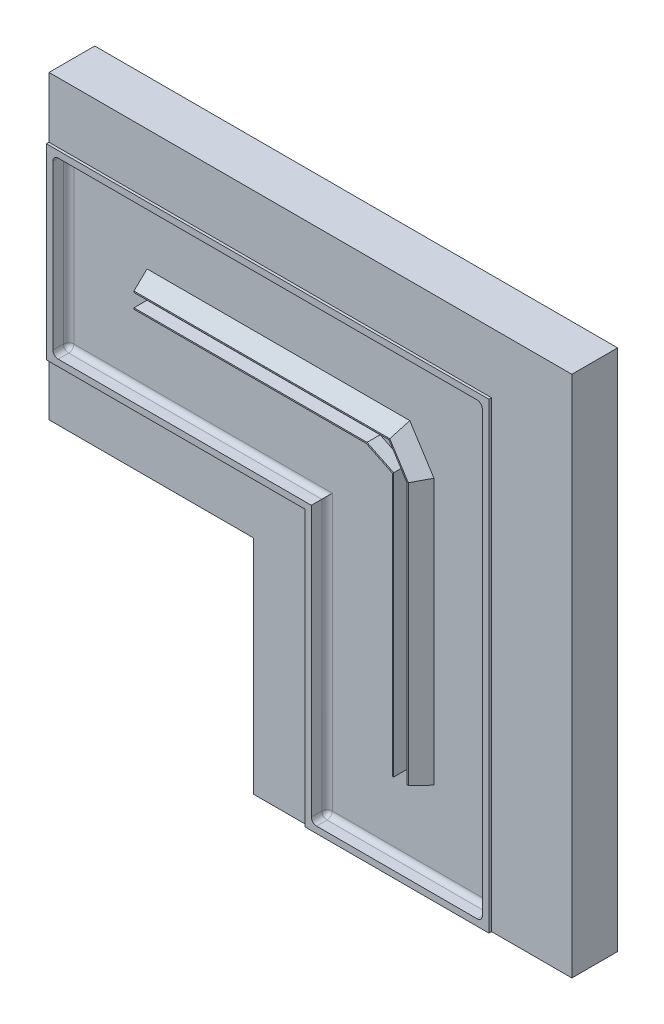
ISO-10303-21;
HEADER;
FILE_DESCRIPTION(('STEP AP214'),'2;1');
FILE_NAME('part.step','',(''),(''),'','','');
FILE_SCHEMA(('AUTOMOTIVE_DESIGN { 1 0 10303 214 1 1 1 1 }'));
ENDSEC;
DATA;
#1=APPLICATION_CONTEXT('core data for automotive mechanical design processes');
#2=APPLICATION_PROTOCOL_DEFINITION('international standard','automotive_design',2000,#1);
#3=PRODUCT_CONTEXT('',#1,'mechanical');
#4=PRODUCT('Part','Part','',(#3));
#5=PRODUCT_RELATED_PRODUCT_CATEGORY('part','',(#4));
#6=PRODUCT_DEFINITION_FORMATION('','',#4);
#7=PRODUCT_DEFINITION_CONTEXT('part definition',#1,'design');
#8=PRODUCT_DEFINITION('design','',#6,#7);
#9=PRODUCT_DEFINITION_SHAPE('','',#8);
#10=(LENGTH_UNIT() NAMED_UNIT(*) SI_UNIT(.MILLI.,.METRE.));
#11=(NAMED_UNIT(*) PLANE_ANGLE_UNIT() SI_UNIT($,.RADIAN.));
#12=(NAMED_UNIT(*) SI_UNIT($,.STERADIAN.) SOLID_ANGLE_UNIT());
#13=UNCERTAINTY_MEASURE_WITH_UNIT(LENGTH_MEASURE(1.E-05),#10,'distance_accuracy_value','');
#14=(GEOMETRIC_REPRESENTATION_CONTEXT(3) GLOBAL_UNCERTAINTY_ASSIGNED_CONTEXT((#13)) GLOBAL_UNIT_ASSIGNED_CONTEXT((#10,
#11,#12)) REPRESENTATION_CONTEXT('',''));
#15=CARTESIAN_POINT('',(0.,0.,0.));
#16=DIRECTION('',(0.,0.,1.));
#17=DIRECTION('',(1.,0.,0.));
#18=AXIS2_PLACEMENT_3D('',#15,#16,#17);
#19=CARTESIAN_POINT('',(0.,0.,2.));
#20=DIRECTION('',(0.,0.,-1.));
#21=DIRECTION('',(-1.,0.,0.));
#22=AXIS2_PLACEMENT_3D('',#19,#20,#21);
#23=PLANE('',#22);
#24=DIRECTION('',(-1.,0.,0.));
#25=VECTOR('',#24,1.);
#26=CARTESIAN_POINT('',(0.,-25.3985290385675,2.));
#27=LINE('',#26,#25);
#28=CARTESIAN_POINT('',(-15.0481887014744,-25.3985290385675,2.));
#29=VERTEX_POINT('',#28);
#30=CARTESIAN_POINT('',(-15.1481887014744,-25.3985290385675,2.));
#31=VERTEX_POINT('',#30);
#32=EDGE_CURVE('E411',#29,#31,#27,.T.);
#33=ORIENTED_EDGE('',*,*,#32,.F.);
#34=DIRECTION('',(0.,-1.,0.));
#35=VECTOR('',#34,1.);
#36=CARTESIAN_POINT('',(-15.0481887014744,0.,2.));
#37=LINE('',#36,#35);
#38=CARTESIAN_POINT('',(-15.0481887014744,-5.23462437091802,2.));
#39=VERTEX_POINT('',#38);
#40=EDGE_CURVE('E398',#39,#29,#37,.T.);
#41=ORIENTED_EDGE('',*,*,#40,.F.);
#42=DIRECTION('',(-0.899301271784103,0.437329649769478,0.));
#43=VECTOR('',#42,1.);
#44=CARTESIAN_POINT('',(-4.93680600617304,-10.1517834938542,2.));
#45=LINE('',#44,#43);
#46=CARTESIAN_POINT('',(-17.0869077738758,-4.24319655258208,2.));
#47=VERTEX_POINT('',#46);
#48=EDGE_CURVE('E480',#39,#47,#45,.T.);
#49=ORIENTED_EDGE('',*,*,#48,.T.);
#50=DIRECTION('',(-1.,0.,0.));
#51=VECTOR('',#50,1.);
#52=CARTESIAN_POINT('',(0.,-4.24319655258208,2.));
#53=LINE('',#52,#51);
#54=CARTESIAN_POINT('',(-34.9177430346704,-4.24319655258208,2.));
#55=VERTEX_POINT('',#54);
#56=EDGE_CURVE('E494',#47,#55,#53,.T.);
#57=ORIENTED_EDGE('',*,*,#56,.T.);
#58=DIRECTION('',(0.,1.,0.));
#59=VECTOR('',#58,1.);
#60=CARTESIAN_POINT('',(-34.9177430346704,0.,2.));
#61=LINE('',#60,#59);
#62=CARTESIAN_POINT('',(-34.9177430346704,-4.34319655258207,2.));
#63=VERTEX_POINT('',#62);
#64=EDGE_CURVE('E706',#63,#55,#61,.T.);
#65=ORIENTED_EDGE('',*,*,#64,.F.);
#66=DIRECTION('',(1.,0.,0.));
#67=VECTOR('',#66,1.);
#68=CARTESIAN_POINT('',(-17.384892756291,-4.34319655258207,2.));
#69=LINE('',#68,#67);
#70=CARTESIAN_POINT('',(-17.1546345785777,-4.34319655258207,2.));
#71=VERTEX_POINT('',#70);
#72=EDGE_CURVE('E541',#63,#71,#69,.T.);
#73=ORIENTED_EDGE('',*,*,#72,.T.);
#74=DIRECTION('',(0.899301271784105,-0.437329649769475,0.));
#75=VECTOR('',#74,1.);
#76=CARTESIAN_POINT('',(-4.9890883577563,-10.2592941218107,2.));
#77=LINE('',#76,#75);
#78=CARTESIAN_POINT('',(-15.1481887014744,-5.31892993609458,2.));
#79=VERTEX_POINT('',#78);
#80=EDGE_CURVE('E532',#71,#79,#77,.T.);
#81=ORIENTED_EDGE('',*,*,#80,.T.);
#82=DIRECTION('',(0.,-1.,0.));
#83=VECTOR('',#82,1.);
#84=CARTESIAN_POINT('',(-15.1481887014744,0.,2.));
#85=LINE('',#84,#83);
#86=EDGE_CURVE('E538',#79,#31,#85,.T.);
#87=ORIENTED_EDGE('',*,*,#86,.T.);
#88=EDGE_LOOP('',(#33,#41,#49,#57,#65,#73,#81,#87));
#89=FACE_BOUND('',#88,.T.);
#90=ADVANCED_FACE('F114',(#89),#23,.F.);
#91=CARTESIAN_POINT('',(0.,-25.3985290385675,-5.77594876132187));
#92=DIRECTION('',(0.,1.,0.));
#93=DIRECTION('',(0.,0.,1.));
#94=AXIS2_PLACEMENT_3D('',#91,#92,#93);
#95=PLANE('',#94);
#96=DIRECTION('',(0.,0.,-1.));
#97=VECTOR('',#96,1.);
#98=CARTESIAN_POINT('',(-15.0481887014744,-25.3985290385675,-5.77594876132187));
#99=LINE('',#98,#97);
#100=CARTESIAN_POINT('',(-15.0481887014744,-25.3985290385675,1.));
#101=VERTEX_POINT('',#100);
#102=EDGE_CURVE('E12',#29,#101,#99,.T.);
#103=ORIENTED_EDGE('',*,*,#102,.F.);
#104=ORIENTED_EDGE('',*,*,#32,.T.);
#105=DIRECTION('',(0.694658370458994,0.,0.719339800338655));
#106=VECTOR('',#105,1.);
#107=CARTESIAN_POINT('',(-16.1481887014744,-25.3985290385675,0.964469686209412));
#108=LINE('',#107,#106);
#109=CARTESIAN_POINT('',(-16.1138774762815,-25.3985290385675,1.));
#110=VERTEX_POINT('',#109);
#111=EDGE_CURVE('E418',#31,#110,#108,.F.);
#112=ORIENTED_EDGE('',*,*,#111,.T.);
#113=DIRECTION('',(1.,0.,0.));
#114=VECTOR('',#113,1.);
#115=CARTESIAN_POINT('',(0.,-25.3985290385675,1.));
#116=LINE('',#115,#114);
#117=EDGE_CURVE('E413',#110,#101,#116,.T.);
#118=ORIENTED_EDGE('',*,*,#117,.T.);
#119=EDGE_LOOP('',(#103,#104,#112,#118));
#120=FACE_BOUND('',#119,.T.);
#121=ADVANCED_FACE('F802',(#120),#95,.F.);
#122=DIRECTION('',(0.,-1.,0.));
#123=VECTOR('',#122,1.);
#124=CARTESIAN_POINT('',(-14.0309980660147,0.,2.));
#125=LINE('',#124,#123);
#126=CARTESIAN_POINT('',(-14.0309980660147,-5.38583748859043,2.));
#127=VERTEX_POINT('',#126);
#128=CARTESIAN_POINT('',(-14.0309980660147,-25.3985290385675,2.));
#129=VERTEX_POINT('',#128);
#130=EDGE_CURVE('E387',#127,#129,#125,.T.);
#131=ORIENTED_EDGE('',*,*,#130,.T.);
#132=CARTESIAN_POINT('',(-13.9309980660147,-25.3985290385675,2.));
#133=VERTEX_POINT('',#132);
#134=EDGE_CURVE('E391',#133,#129,#27,.T.);
#135=ORIENTED_EDGE('',*,*,#134,.F.);
#136=DIRECTION('',(0.,1.,0.));
#137=VECTOR('',#136,1.);
#138=CARTESIAN_POINT('',(-13.9309980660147,0.,2.));
#139=LINE('',#138,#137);
#140=CARTESIAN_POINT('',(-13.9309980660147,-5.34135151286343,2.));
#141=VERTEX_POINT('',#140);
#142=EDGE_CURVE('E550',#133,#141,#139,.T.);
#143=ORIENTED_EDGE('',*,*,#142,.T.);
#144=DIRECTION('',(-0.539562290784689,0.84194568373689,0.));
#145=VECTOR('',#144,1.);
#146=CARTESIAN_POINT('',(-12.3017825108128,-7.88361776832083,2.));
#147=LINE('',#146,#145);
#148=CARTESIAN_POINT('',(-15.3470056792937,-3.13177994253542,2.));
#149=VERTEX_POINT('',#148);
#150=EDGE_CURVE('E558',#141,#149,#147,.T.);
#151=ORIENTED_EDGE('',*,*,#150,.T.);
#152=DIRECTION('',(-1.,0.,0.));
#153=VECTOR('',#152,1.);
#154=CARTESIAN_POINT('',(-41.4177430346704,-3.13177994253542,2.));
#155=LINE('',#154,#153);
#156=CARTESIAN_POINT('',(-34.9177430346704,-3.13177994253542,2.));
#157=VERTEX_POINT('',#156);
#158=EDGE_CURVE('E560',#149,#157,#155,.T.);
#159=ORIENTED_EDGE('',*,*,#158,.T.);
#160=CARTESIAN_POINT('',(-34.9177430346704,-3.23177994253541,2.));
#161=VERTEX_POINT('',#160);
#162=EDGE_CURVE('E712',#161,#157,#61,.T.);
#163=ORIENTED_EDGE('',*,*,#162,.F.);
#164=DIRECTION('',(-1.,0.,0.));
#165=VECTOR('',#164,1.);
#166=CARTESIAN_POINT('',(0.,-3.23177994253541,2.));
#167=LINE('',#166,#165);
#168=CARTESIAN_POINT('',(-15.4114294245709,-3.23177994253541,2.));
#169=VERTEX_POINT('',#168);
#170=EDGE_CURVE('E492',#169,#161,#167,.T.);
#171=ORIENTED_EDGE('',*,*,#170,.F.);
#172=DIRECTION('',(0.539562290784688,-0.84194568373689,0.));
#173=VECTOR('',#172,1.);
#174=CARTESIAN_POINT('',(-12.3928789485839,-7.94199707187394,2.));
#175=LINE('',#174,#173);
#176=EDGE_CURVE('E395',#169,#127,#175,.T.);
#177=ORIENTED_EDGE('',*,*,#176,.T.);
#178=EDGE_LOOP('',(#131,#135,#143,#151,#159,#163,#171,#177));
#179=FACE_BOUND('',#178,.T.);
#180=ADVANCED_FACE('F389',(#179),#23,.F.);
#181=CARTESIAN_POINT('',(-34.9177430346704,0.,-5.77594876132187));
#182=DIRECTION('',(1.,0.,0.));
#183=DIRECTION('',(0.,0.,-1.));
#184=AXIS2_PLACEMENT_3D('',#181,#182,#183);
#185=PLANE('',#184);
#186=DIRECTION('',(0.,0.,-1.));
#187=VECTOR('',#186,1.);
#188=CARTESIAN_POINT('',(-34.9177430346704,-3.23177994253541,-5.77594876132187));
#189=LINE('',#188,#187);
#190=CARTESIAN_POINT('',(-34.9177430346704,-3.23177994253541,1.));
#191=VERTEX_POINT('',#190);
#192=EDGE_CURVE('E406',#161,#191,#189,.T.);
#193=ORIENTED_EDGE('',*,*,#192,.F.);
#194=ORIENTED_EDGE('',*,*,#162,.T.);
#195=DIRECTION('',(0.,0.694658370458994,-0.719339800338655));
#196=VECTOR('',#195,1.);
#197=CARTESIAN_POINT('',(-34.9177430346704,-3.13177994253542,2.));
#198=LINE('',#197,#196);
#199=CARTESIAN_POINT('',(-34.9177430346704,-2.16609116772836,1.));
#200=VERTEX_POINT('',#199);
#201=EDGE_CURVE('E575',#157,#200,#198,.T.);
#202=ORIENTED_EDGE('',*,*,#201,.T.);
#203=DIRECTION('',(0.,-1.,0.));
#204=VECTOR('',#203,1.);
#205=CARTESIAN_POINT('',(-34.9177430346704,0.,1.));
#206=LINE('',#205,#204);
#207=EDGE_CURVE('E700',#200,#191,#206,.T.);
#208=ORIENTED_EDGE('',*,*,#207,.T.);
#209=EDGE_LOOP('',(#193,#194,#202,#208));
#210=FACE_BOUND('',#209,.T.);
#211=ADVANCED_FACE('F701',(#210),#185,.F.);
#212=CARTESIAN_POINT('',(-8.4646281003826,-30.9985290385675,1.4));
#213=DIRECTION('',(1.,0.,0.));
#214=DIRECTION('',(0.,0.,-1.));
#215=AXIS2_PLACEMENT_3D('',#212,#213,#214);
#216=SPHERICAL_SURFACE('',#215,0.4);
#217=CARTESIAN_POINT('',(-8.4646281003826,-30.9985290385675,1.4));
#218=DIRECTION('',(0.,0.,-1.));
#219=DIRECTION('',(-1.,0.,0.));
#220=AXIS2_PLACEMENT_3D('',#217,#218,#219);
#221=CIRCLE('',#220,0.4);
#222=CARTESIAN_POINT('',(-8.0646281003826,-30.9985290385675,1.4));
#223=VERTEX_POINT('',#222);
#224=CARTESIAN_POINT('',(-8.4646281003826,-31.3985290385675,1.4));
#225=VERTEX_POINT('',#224);
#226=EDGE_CURVE('E687',#223,#225,#221,.T.);
#227=ORIENTED_EDGE('',*,*,#226,.F.);
#228=CARTESIAN_POINT('',(-8.4646281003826,-30.9985290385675,1.4));
#229=DIRECTION('',(0.,1.,0.));
#230=DIRECTION('',(0.,0.,1.));
#231=AXIS2_PLACEMENT_3D('',#228,#229,#230);
#232=CIRCLE('',#231,0.4);
#233=CARTESIAN_POINT('',(-8.4646281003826,-30.9985290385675,1.));
#234=VERTEX_POINT('',#233);
#235=EDGE_CURVE('E685',#223,#234,#232,.T.);
#236=ORIENTED_EDGE('',*,*,#235,.T.);
#237=CARTESIAN_POINT('',(-8.4646281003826,-30.9985290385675,1.4));
#238=DIRECTION('',(1.,0.,0.));
#239=DIRECTION('',(0.,0.,-1.));
#240=AXIS2_PLACEMENT_3D('',#237,#238,#239);
#241=CIRCLE('',#240,0.4);
#242=EDGE_CURVE('E673',#225,#234,#241,.T.);
#243=ORIENTED_EDGE('',*,*,#242,.F.);
#244=EDGE_LOOP('',(#227,#236,#243));
#245=FACE_BOUND('',#244,.T.);
#246=ADVANCED_FACE('F879',(#245),#216,.F.);
#247=CARTESIAN_POINT('',(-8.4646281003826,0.,1.4));
#248=DIRECTION('',(0.,-1.,0.));
#249=DIRECTION('',(0.,0.,-1.));
#250=AXIS2_PLACEMENT_3D('',#247,#248,#249);
#251=CYLINDRICAL_SURFACE('',#250,0.4);
#252=ORIENTED_EDGE('',*,*,#235,.F.);
#253=DIRECTION('',(0.,-1.,0.));
#254=VECTOR('',#253,1.);
#255=CARTESIAN_POINT('',(-8.0646281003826,0.,1.4));
#256=LINE('',#255,#254);
#257=CARTESIAN_POINT('',(-8.0646281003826,2.57599808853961,1.4));
#258=VERTEX_POINT('',#257);
#259=EDGE_CURVE('E658',#258,#223,#256,.T.);
#260=ORIENTED_EDGE('',*,*,#259,.F.);
#261=CARTESIAN_POINT('',(-8.4646281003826,2.57599808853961,1.4));
#262=DIRECTION('',(0.,1.,0.));
#263=DIRECTION('',(0.,0.,1.));
#264=AXIS2_PLACEMENT_3D('',#261,#262,#263);
#265=CIRCLE('',#264,0.4);
#266=CARTESIAN_POINT('',(-8.4646281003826,2.57599808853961,1.));
#267=VERTEX_POINT('',#266);
#268=EDGE_CURVE('E683',#258,#267,#265,.T.);
#269=ORIENTED_EDGE('',*,*,#268,.T.);
#270=DIRECTION('',(0.,-1.,0.));
#271=VECTOR('',#270,1.);
#272=CARTESIAN_POINT('',(-8.4646281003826,0.,1.));
#273=LINE('',#272,#271);
#274=EDGE_CURVE('E670',#234,#267,#273,.F.);
#275=ORIENTED_EDGE('',*,*,#274,.F.);
#276=EDGE_LOOP('',(#252,#260,#269,#275));
#277=FACE_BOUND('',#276,.T.);
#278=ADVANCED_FACE('F876',(#277),#251,.F.);
#279=CARTESIAN_POINT('',(-8.4646281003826,2.57599808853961,1.4));
#280=DIRECTION('',(1.,0.,0.));
#281=DIRECTION('',(0.,0.,-1.));
#282=AXIS2_PLACEMENT_3D('',#279,#280,#281);
#283=SPHERICAL_SURFACE('',#282,0.4);
#284=ORIENTED_EDGE('',*,*,#268,.F.);
#285=CARTESIAN_POINT('',(-8.4646281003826,2.57599808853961,1.4));
#286=DIRECTION('',(0.,0.,1.));
#287=DIRECTION('',(1.,0.,0.));
#288=AXIS2_PLACEMENT_3D('',#285,#286,#287);
#289=CIRCLE('',#288,0.4);
#290=CARTESIAN_POINT('',(-8.4646281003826,2.97599808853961,1.4));
#291=VERTEX_POINT('',#290);
#292=EDGE_CURVE('E681',#258,#291,#289,.T.);
#293=ORIENTED_EDGE('',*,*,#292,.T.);
#294=CARTESIAN_POINT('',(-8.4646281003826,2.57599808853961,1.4));
#295=DIRECTION('',(1.,0.,0.));
#296=DIRECTION('',(0.,1.,0.));
#297=AXIS2_PLACEMENT_3D('',#294,#295,#296);
#298=CIRCLE('',#297,0.4);
#299=EDGE_CURVE('E667',#267,#291,#298,.T.);
#300=ORIENTED_EDGE('',*,*,#299,.F.);
#301=EDGE_LOOP('',(#284,#293,#300));
#302=FACE_BOUND('',#301,.T.);
#303=ADVANCED_FACE('F872',(#302),#283,.F.);
#304=CARTESIAN_POINT('',(-8.4646281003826,2.57599808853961,1.));
#305=DIRECTION('',(0.,0.,1.));
#306=DIRECTION('',(1.,0.,0.));
#307=AXIS2_PLACEMENT_3D('',#304,#305,#306);
#308=CYLINDRICAL_SURFACE('',#307,0.4);
#309=ORIENTED_EDGE('',*,*,#292,.F.);
#310=DIRECTION('',(0.,0.,-1.));
#311=VECTOR('',#310,1.);
#312=CARTESIAN_POINT('',(-8.0646281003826,2.57599808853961,1.));
#313=LINE('',#312,#311);
#314=CARTESIAN_POINT('',(-8.0646281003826,2.57599808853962,2.2));
#315=VERTEX_POINT('',#314);
#316=EDGE_CURVE('E661',#315,#258,#313,.T.);
#317=ORIENTED_EDGE('',*,*,#316,.F.);
#318=CARTESIAN_POINT('',(-8.4646281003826,2.57599808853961,2.2));
#319=DIRECTION('',(0.,0.,1.));
#320=DIRECTION('',(1.,0.,0.));
#321=AXIS2_PLACEMENT_3D('',#318,#319,#320);
#322=CIRCLE('',#321,0.4);
#323=CARTESIAN_POINT('',(-8.4646281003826,2.97599808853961,2.2));
#324=VERTEX_POINT('',#323);
#325=EDGE_CURVE('E679',#315,#324,#322,.T.);
#326=ORIENTED_EDGE('',*,*,#325,.T.);
#327=DIRECTION('',(0.,0.,-1.));
#328=VECTOR('',#327,1.);
#329=CARTESIAN_POINT('',(-8.4646281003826,2.97599808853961,1.));
#330=LINE('',#329,#328);
#331=EDGE_CURVE('E664',#291,#324,#330,.F.);
#332=ORIENTED_EDGE('',*,*,#331,.F.);
#333=EDGE_LOOP('',(#309,#317,#326,#332));
#334=FACE_BOUND('',#333,.T.);
#335=ADVANCED_FACE('F869',(#334),#308,.F.);
#336=CARTESIAN_POINT('',(-8.4646281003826,-30.9985290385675,1.));
#337=DIRECTION('',(0.,0.,1.));
#338=DIRECTION('',(1.,0.,0.));
#339=AXIS2_PLACEMENT_3D('',#336,#337,#338);
#340=CYLINDRICAL_SURFACE('',#339,0.4);
#341=DIRECTION('',(0.,0.,1.));
#342=VECTOR('',#341,1.);
#343=CARTESIAN_POINT('',(-8.0646281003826,-30.9985290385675,1.));
#344=LINE('',#343,#342);
#345=CARTESIAN_POINT('',(-8.0646281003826,-30.9985290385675,2.2));
#346=VERTEX_POINT('',#345);
#347=EDGE_CURVE('E655',#223,#346,#344,.T.);
#348=ORIENTED_EDGE('',*,*,#347,.F.);
#349=ORIENTED_EDGE('',*,*,#226,.T.);
#350=DIRECTION('',(0.,0.,1.));
#351=VECTOR('',#350,1.);
#352=CARTESIAN_POINT('',(-8.4646281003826,-31.3985290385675,0.2));
#353=LINE('',#352,#351);
#354=CARTESIAN_POINT('',(-8.4646281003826,-31.3985290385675,2.2));
#355=VERTEX_POINT('',#354);
#356=EDGE_CURVE('E676',#355,#225,#353,.F.);
#357=ORIENTED_EDGE('',*,*,#356,.F.);
#358=CARTESIAN_POINT('',(-8.4646281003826,-30.9985290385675,2.2));
#359=DIRECTION('',(0.,0.,1.));
#360=DIRECTION('',(1.,0.,0.));
#361=AXIS2_PLACEMENT_3D('',#358,#359,#360);
#362=CIRCLE('',#361,0.4);
#363=EDGE_CURVE('E689',#355,#346,#362,.T.);
#364=ORIENTED_EDGE('',*,*,#363,.T.);
#365=EDGE_LOOP('',(#348,#349,#357,#364));
#366=FACE_BOUND('',#365,.T.);
#367=ADVANCED_FACE('F116',(#366),#340,.F.);
#368=CARTESIAN_POINT('',(-40.5177430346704,3.47599808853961,1.4));
#369=DIRECTION('',(0.,-1.,0.));
#370=DIRECTION('',(0.,0.,-1.));
#371=AXIS2_PLACEMENT_3D('',#368,#369,#370);
#372=CYLINDRICAL_SURFACE('',#371,0.4);
#373=DIRECTION('',(0.,1.,0.));
#374=VECTOR('',#373,1.);
#375=CARTESIAN_POINT('',(-40.5177430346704,3.47599808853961,1.));
#376=LINE('',#375,#374);
#377=CARTESIAN_POINT('',(-40.5177430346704,2.57599808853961,1.));
#378=VERTEX_POINT('',#377);
#379=CARTESIAN_POINT('',(-40.5177430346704,-9.94319655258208,1.));
#380=VERTEX_POINT('',#379);
#381=EDGE_CURVE('E625',#378,#380,#376,.F.);
#382=ORIENTED_EDGE('',*,*,#381,.F.);
#383=CARTESIAN_POINT('',(-40.5177430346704,2.57599808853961,1.4));
#384=DIRECTION('',(0.,-1.,0.));
#385=DIRECTION('',(0.,0.,-1.));
#386=AXIS2_PLACEMENT_3D('',#383,#384,#385);
#387=CIRCLE('',#386,0.4);
#388=CARTESIAN_POINT('',(-40.9177430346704,2.57599808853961,1.4));
#389=VERTEX_POINT('',#388);
#390=EDGE_CURVE('E643',#378,#389,#387,.F.);
#391=ORIENTED_EDGE('',*,*,#390,.T.);
#392=DIRECTION('',(0.,1.,0.));
#393=VECTOR('',#392,1.);
#394=CARTESIAN_POINT('',(-40.9177430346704,3.47599808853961,1.4));
#395=LINE('',#394,#393);
#396=CARTESIAN_POINT('',(-40.9177430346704,-9.94319655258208,1.4));
#397=VERTEX_POINT('',#396);
#398=EDGE_CURVE('E613',#397,#389,#395,.T.);
#399=ORIENTED_EDGE('',*,*,#398,.F.);
#400=CARTESIAN_POINT('',(-40.5177430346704,-9.94319655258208,1.4));
#401=DIRECTION('',(0.,-1.,0.));
#402=DIRECTION('',(0.,0.,-1.));
#403=AXIS2_PLACEMENT_3D('',#400,#401,#402);
#404=CIRCLE('',#403,0.4);
#405=EDGE_CURVE('E631',#397,#380,#404,.T.);
#406=ORIENTED_EDGE('',*,*,#405,.T.);
#407=EDGE_LOOP('',(#382,#391,#399,#406));
#408=FACE_BOUND('',#407,.T.);
#409=ADVANCED_FACE('F861',(#408),#372,.F.);
#410=CARTESIAN_POINT('',(-40.5177430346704,2.57599808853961,1.4));
#411=DIRECTION('',(0.,1.,0.));
#412=DIRECTION('',(-1.,0.,0.));
#413=AXIS2_PLACEMENT_3D('',#410,#411,#412);
#414=SPHERICAL_SURFACE('',#413,0.4);
#415=CARTESIAN_POINT('',(-40.5177430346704,2.57599808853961,1.4));
#416=DIRECTION('',(-1.,0.,0.));
#417=DIRECTION('',(0.,0.,1.));
#418=AXIS2_PLACEMENT_3D('',#415,#416,#417);
#419=CIRCLE('',#418,0.4);
#420=CARTESIAN_POINT('',(-40.5177430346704,2.97599808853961,1.4));
#421=VERTEX_POINT('',#420);
#422=EDGE_CURVE('E652',#421,#378,#419,.T.);
#423=ORIENTED_EDGE('',*,*,#422,.F.);
#424=CARTESIAN_POINT('',(-40.5177430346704,2.57599808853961,1.4));
#425=DIRECTION('',(0.,0.,1.));
#426=DIRECTION('',(1.,0.,0.));
#427=AXIS2_PLACEMENT_3D('',#424,#425,#426);
#428=CIRCLE('',#427,0.4);
#429=EDGE_CURVE('E650',#421,#389,#428,.T.);
#430=ORIENTED_EDGE('',*,*,#429,.T.);
#431=ORIENTED_EDGE('',*,*,#390,.F.);
#432=EDGE_LOOP('',(#423,#430,#431));
#433=FACE_BOUND('',#432,.T.);
#434=ADVANCED_FACE('F857',(#433),#414,.F.);
#435=CARTESIAN_POINT('',(-40.5177430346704,2.57599808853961,1.));
#436=DIRECTION('',(0.,0.,-1.));
#437=DIRECTION('',(-1.,0.,0.));
#438=AXIS2_PLACEMENT_3D('',#435,#436,#437);
#439=CYLINDRICAL_SURFACE('',#438,0.4);
#440=ORIENTED_EDGE('',*,*,#429,.F.);
#441=DIRECTION('',(0.,0.,-1.));
#442=VECTOR('',#441,1.);
#443=CARTESIAN_POINT('',(-40.5177430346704,2.97599808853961,1.));
#444=LINE('',#443,#442);
#445=CARTESIAN_POINT('',(-40.5177430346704,2.97599808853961,2.2));
#446=VERTEX_POINT('',#445);
#447=EDGE_CURVE('E637',#446,#421,#444,.T.);
#448=ORIENTED_EDGE('',*,*,#447,.F.);
#449=CARTESIAN_POINT('',(-40.5177430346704,2.57599808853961,2.2));
#450=DIRECTION('',(0.,0.,1.));
#451=DIRECTION('',(1.,0.,0.));
#452=AXIS2_PLACEMENT_3D('',#449,#450,#451);
#453=CIRCLE('',#452,0.4);
#454=CARTESIAN_POINT('',(-40.9177430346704,2.57599808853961,2.2));
#455=VERTEX_POINT('',#454);
#456=EDGE_CURVE('E648',#446,#455,#453,.T.);
#457=ORIENTED_EDGE('',*,*,#456,.T.);
#458=DIRECTION('',(0.,0.,-1.));
#459=VECTOR('',#458,1.);
#460=CARTESIAN_POINT('',(-40.9177430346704,2.57599808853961,0.2));
#461=LINE('',#460,#459);
#462=EDGE_CURVE('E640',#389,#455,#461,.F.);
#463=ORIENTED_EDGE('',*,*,#462,.F.);
#464=EDGE_LOOP('',(#440,#448,#457,#463));
#465=FACE_BOUND('',#464,.T.);
#466=ADVANCED_FACE('F854',(#465),#439,.F.);
#467=CARTESIAN_POINT('',(0.,2.57599808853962,1.4));
#468=DIRECTION('',(1.,0.,0.));
#469=DIRECTION('',(0.,1.,0.));
#470=AXIS2_PLACEMENT_3D('',#467,#468,#469);
#471=CYLINDRICAL_SURFACE('',#470,0.4);
#472=DIRECTION('',(1.,0.,0.));
#473=VECTOR('',#472,1.);
#474=CARTESIAN_POINT('',(0.,2.57599808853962,1.));
#475=LINE('',#474,#473);
#476=EDGE_CURVE('E646',#267,#378,#475,.F.);
#477=ORIENTED_EDGE('',*,*,#476,.F.);
#478=ORIENTED_EDGE('',*,*,#299,.T.);
#479=DIRECTION('',(1.,0.,0.));
#480=VECTOR('',#479,1.);
#481=CARTESIAN_POINT('',(0.,2.97599808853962,1.4));
#482=LINE('',#481,#480);
#483=EDGE_CURVE('E634',#421,#291,#482,.T.);
#484=ORIENTED_EDGE('',*,*,#483,.F.);
#485=ORIENTED_EDGE('',*,*,#422,.T.);
#486=EDGE_LOOP('',(#477,#478,#484,#485));
#487=FACE_BOUND('',#486,.T.);
#488=ADVANCED_FACE('F852',(#487),#471,.F.);
#489=CARTESIAN_POINT('',(-40.5177430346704,-9.94319655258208,1.4));
#490=DIRECTION('',(1.,0.,0.));
#491=DIRECTION('',(0.,0.,-1.));
#492=AXIS2_PLACEMENT_3D('',#489,#490,#491);
#493=SPHERICAL_SURFACE('',#492,0.4);
#494=ORIENTED_EDGE('',*,*,#405,.F.);
#495=CARTESIAN_POINT('',(-40.5177430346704,-9.94319655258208,1.4));
#496=DIRECTION('',(0.,0.,1.));
#497=DIRECTION('',(1.,0.,0.));
#498=AXIS2_PLACEMENT_3D('',#495,#496,#497);
#499=CIRCLE('',#498,0.4);
#500=CARTESIAN_POINT('',(-40.5177430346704,-10.3431965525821,1.4));
#501=VERTEX_POINT('',#500);
#502=EDGE_CURVE('E629',#397,#501,#499,.T.);
#503=ORIENTED_EDGE('',*,*,#502,.T.);
#504=CARTESIAN_POINT('',(-40.5177430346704,-9.94319655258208,1.4));
#505=DIRECTION('',(-1.,0.,0.));
#506=DIRECTION('',(0.,0.,1.));
#507=AXIS2_PLACEMENT_3D('',#504,#505,#506);
#508=CIRCLE('',#507,0.4);
#509=EDGE_CURVE('E622',#380,#501,#508,.T.);
#510=ORIENTED_EDGE('',*,*,#509,.F.);
#511=EDGE_LOOP('',(#494,#503,#510));
#512=FACE_BOUND('',#511,.T.);
#513=ADVANCED_FACE('F848',(#512),#493,.F.);
#514=CARTESIAN_POINT('',(-40.5177430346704,-9.94319655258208,0.2));
#515=DIRECTION('',(0.,0.,-1.));
#516=DIRECTION('',(-1.,0.,0.));
#517=AXIS2_PLACEMENT_3D('',#514,#515,#516);
#518=CYLINDRICAL_SURFACE('',#517,0.4);
#519=ORIENTED_EDGE('',*,*,#502,.F.);
#520=DIRECTION('',(0.,0.,-1.));
#521=VECTOR('',#520,1.);
#522=CARTESIAN_POINT('',(-40.9177430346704,-9.94319655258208,0.2));
#523=LINE('',#522,#521);
#524=CARTESIAN_POINT('',(-40.9177430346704,-9.94319655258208,2.2));
#525=VERTEX_POINT('',#524);
#526=EDGE_CURVE('E616',#525,#397,#523,.T.);
#527=ORIENTED_EDGE('',*,*,#526,.F.);
#528=CARTESIAN_POINT('',(-40.5177430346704,-9.94319655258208,2.2));
#529=DIRECTION('',(0.,0.,1.));
#530=DIRECTION('',(1.,0.,0.));
#531=AXIS2_PLACEMENT_3D('',#528,#529,#530);
#532=CIRCLE('',#531,0.4);
#533=CARTESIAN_POINT('',(-40.5177430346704,-10.3431965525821,2.2));
#534=VERTEX_POINT('',#533);
#535=EDGE_CURVE('E627',#525,#534,#532,.T.);
#536=ORIENTED_EDGE('',*,*,#535,.T.);
#537=DIRECTION('',(0.,0.,-1.));
#538=VECTOR('',#537,1.);
#539=CARTESIAN_POINT('',(-40.5177430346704,-10.3431965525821,1.));
#540=LINE('',#539,#538);
#541=EDGE_CURVE('E619',#501,#534,#540,.F.);
#542=ORIENTED_EDGE('',*,*,#541,.F.);
#543=EDGE_LOOP('',(#519,#527,#536,#542));
#544=FACE_BOUND('',#543,.T.);
#545=ADVANCED_FACE('F844',(#544),#518,.F.);
#546=CARTESIAN_POINT('',(0.,-9.94319655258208,1.4));
#547=DIRECTION('',(-1.,0.,0.));
#548=DIRECTION('',(0.,0.,1.));
#549=AXIS2_PLACEMENT_3D('',#546,#547,#548);
#550=CYLINDRICAL_SURFACE('',#549,0.4);
#551=DIRECTION('',(-1.,0.,0.));
#552=VECTOR('',#551,1.);
#553=CARTESIAN_POINT('',(0.,-9.94319655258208,1.));
#554=LINE('',#553,#552);
#555=CARTESIAN_POINT('',(-20.7481887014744,-9.94319655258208,1.));
#556=VERTEX_POINT('',#555);
#557=EDGE_CURVE('E608',#380,#556,#554,.F.);
#558=ORIENTED_EDGE('',*,*,#557,.F.);
#559=ORIENTED_EDGE('',*,*,#509,.T.);
#560=DIRECTION('',(-1.,0.,0.));
#561=VECTOR('',#560,1.);
#562=CARTESIAN_POINT('',(0.,-10.3431965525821,1.4));
#563=LINE('',#562,#561);
#564=CARTESIAN_POINT('',(-21.1481887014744,-10.3431965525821,1.4));
#565=VERTEX_POINT('',#564);
#566=EDGE_CURVE('E605',#565,#501,#563,.T.);
#567=ORIENTED_EDGE('',*,*,#566,.F.);
#568=CARTESIAN_POINT('',(-20.7481887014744,-9.94319655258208,1.4));
#569=DIRECTION('',(0.707106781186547,-0.707106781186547,0.));
#570=DIRECTION('',(-0.707106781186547,-0.707106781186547,0.));
#571=AXIS2_PLACEMENT_3D('',#568,#569,#570);
#572=ELLIPSE('',#571,0.565685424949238,0.4);
#573=EDGE_CURVE('E610',#565,#556,#572,.T.);
#574=ORIENTED_EDGE('',*,*,#573,.T.);
#575=EDGE_LOOP('',(#558,#559,#567,#574));
#576=FACE_BOUND('',#575,.T.);
#577=ADVANCED_FACE('F839',(#576),#550,.F.);
#578=CARTESIAN_POINT('',(-20.7481887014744,-30.9985290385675,1.4));
#579=DIRECTION('',(1.,0.,0.));
#580=DIRECTION('',(0.,0.,-1.));
#581=AXIS2_PLACEMENT_3D('',#578,#579,#580);
#582=SPHERICAL_SURFACE('',#581,0.4);
#583=CARTESIAN_POINT('',(-20.7481887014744,-30.9985290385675,1.4));
#584=DIRECTION('',(0.,-1.,0.));
#585=DIRECTION('',(0.,0.,-1.));
#586=AXIS2_PLACEMENT_3D('',#583,#584,#585);
#587=CIRCLE('',#586,0.4);
#588=CARTESIAN_POINT('',(-21.1481887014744,-30.9985290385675,1.4));
#589=VERTEX_POINT('',#588);
#590=CARTESIAN_POINT('',(-20.7481887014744,-30.9985290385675,1.));
#591=VERTEX_POINT('',#590);
#592=EDGE_CURVE('E603',#589,#591,#587,.T.);
#593=ORIENTED_EDGE('',*,*,#592,.F.);
#594=CARTESIAN_POINT('',(-20.7481887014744,-30.9985290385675,1.4));
#595=DIRECTION('',(0.,0.,1.));
#596=DIRECTION('',(1.,0.,0.));
#597=AXIS2_PLACEMENT_3D('',#594,#595,#596);
#598=CIRCLE('',#597,0.4);
#599=CARTESIAN_POINT('',(-20.7481887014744,-31.3985290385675,1.4));
#600=VERTEX_POINT('',#599);
#601=EDGE_CURVE('E600',#589,#600,#598,.T.);
#602=ORIENTED_EDGE('',*,*,#601,.T.);
#603=CARTESIAN_POINT('',(-20.7481887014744,-30.9985290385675,1.4));
#604=DIRECTION('',(1.,0.,0.));
#605=DIRECTION('',(0.,0.,-1.));
#606=AXIS2_PLACEMENT_3D('',#603,#604,#605);
#607=CIRCLE('',#606,0.4);
#608=EDGE_CURVE('E591',#591,#600,#607,.F.);
#609=ORIENTED_EDGE('',*,*,#608,.F.);
#610=EDGE_LOOP('',(#593,#602,#609));
#611=FACE_BOUND('',#610,.T.);
#612=ADVANCED_FACE('F836',(#611),#582,.F.);
#613=CARTESIAN_POINT('',(-20.7481887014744,-30.9985290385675,1.));
#614=DIRECTION('',(0.,0.,1.));
#615=DIRECTION('',(1.,0.,0.));
#616=AXIS2_PLACEMENT_3D('',#613,#614,#615);
#617=CYLINDRICAL_SURFACE('',#616,0.4);
#618=ORIENTED_EDGE('',*,*,#601,.F.);
#619=DIRECTION('',(0.,0.,-1.));
#620=VECTOR('',#619,1.);
#621=CARTESIAN_POINT('',(-21.1481887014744,-30.9985290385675,1.));
#622=LINE('',#621,#620);
#623=CARTESIAN_POINT('',(-21.1481887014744,-30.9985290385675,2.2));
#624=VERTEX_POINT('',#623);
#625=EDGE_CURVE('E585',#624,#589,#622,.T.);
#626=ORIENTED_EDGE('',*,*,#625,.F.);
#627=CARTESIAN_POINT('',(-20.7481887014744,-30.9985290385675,2.2));
#628=DIRECTION('',(0.,0.,1.));
#629=DIRECTION('',(1.,0.,0.));
#630=AXIS2_PLACEMENT_3D('',#627,#628,#629);
#631=CIRCLE('',#630,0.4);
#632=CARTESIAN_POINT('',(-20.7481887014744,-31.3985290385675,2.2));
#633=VERTEX_POINT('',#632);
#634=EDGE_CURVE('E597',#624,#633,#631,.T.);
#635=ORIENTED_EDGE('',*,*,#634,.T.);
#636=DIRECTION('',(0.,0.,-1.));
#637=VECTOR('',#636,1.);
#638=CARTESIAN_POINT('',(-20.7481887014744,-31.3985290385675,1.));
#639=LINE('',#638,#637);
#640=EDGE_CURVE('E588',#600,#633,#639,.F.);
#641=ORIENTED_EDGE('',*,*,#640,.F.);
#642=EDGE_LOOP('',(#618,#626,#635,#641));
#643=FACE_BOUND('',#642,.T.);
#644=ADVANCED_FACE('F826',(#643),#617,.F.);
#645=CARTESIAN_POINT('',(-20.7481887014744,0.,1.4));
#646=DIRECTION('',(0.,-1.,0.));
#647=DIRECTION('',(0.,0.,-1.));
#648=AXIS2_PLACEMENT_3D('',#645,#646,#647);
#649=CYLINDRICAL_SURFACE('',#648,0.4);
#650=DIRECTION('',(0.,1.,0.));
#651=VECTOR('',#650,1.);
#652=CARTESIAN_POINT('',(-21.1481887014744,0.,1.4));
#653=LINE('',#652,#651);
#654=EDGE_CURVE('E582',#589,#565,#653,.T.);
#655=ORIENTED_EDGE('',*,*,#654,.F.);
#656=ORIENTED_EDGE('',*,*,#592,.T.);
#657=DIRECTION('',(0.,1.,0.));
#658=VECTOR('',#657,1.);
#659=CARTESIAN_POINT('',(-20.7481887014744,0.,1.));
#660=LINE('',#659,#658);
#661=EDGE_CURVE('E594',#556,#591,#660,.F.);
#662=ORIENTED_EDGE('',*,*,#661,.F.);
#663=ORIENTED_EDGE('',*,*,#573,.F.);
#664=EDGE_LOOP('',(#655,#656,#662,#663));
#665=FACE_BOUND('',#664,.T.);
#666=ADVANCED_FACE('F820',(#665),#649,.F.);
#667=CARTESIAN_POINT('',(-21.6481887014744,-30.9985290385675,1.4));
#668=DIRECTION('',(1.,0.,0.));
#669=DIRECTION('',(0.,0.,-1.));
#670=AXIS2_PLACEMENT_3D('',#667,#668,#669);
#671=CYLINDRICAL_SURFACE('',#670,0.4);
#672=DIRECTION('',(-1.,0.,0.));
#673=VECTOR('',#672,1.);
#674=CARTESIAN_POINT('',(-21.6481887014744,-31.3985290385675,1.4));
#675=LINE('',#674,#673);
#676=EDGE_CURVE('E577',#225,#600,#675,.T.);
#677=ORIENTED_EDGE('',*,*,#676,.F.);
#678=ORIENTED_EDGE('',*,*,#242,.T.);
#679=DIRECTION('',(-1.,0.,0.));
#680=VECTOR('',#679,1.);
#681=CARTESIAN_POINT('',(-21.6481887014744,-30.9985290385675,1.));
#682=LINE('',#681,#680);
#683=EDGE_CURVE('E579',#591,#234,#682,.F.);
#684=ORIENTED_EDGE('',*,*,#683,.F.);
#685=ORIENTED_EDGE('',*,*,#608,.T.);
#686=EDGE_LOOP('',(#677,#678,#684,#685));
#687=FACE_BOUND('',#686,.T.);
#688=ADVANCED_FACE('F815',(#687),#671,.F.);
#689=DIRECTION('',(0.,1.,0.));
#690=VECTOR('',#689,1.);
#691=CARTESIAN_POINT('',(-7.5646281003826,0.,2.));
#692=LINE('',#691,#690);
#693=CARTESIAN_POINT('',(-7.5646281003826,-31.8985290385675,2.));
#694=VERTEX_POINT('',#693);
#695=CARTESIAN_POINT('',(-7.5646281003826,3.47599808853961,2.));
#696=VERTEX_POINT('',#695);
#697=EDGE_CURVE('E425',#694,#696,#692,.T.);
#698=ORIENTED_EDGE('',*,*,#697,.F.);
#699=DIRECTION('',(1.,0.,0.));
#700=VECTOR('',#699,1.);
#701=CARTESIAN_POINT('',(-41.4177430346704,-31.8985290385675,2.));
#702=LINE('',#701,#700);
#703=CARTESIAN_POINT('',(-1.41774303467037,-31.8985290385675,2.));
#704=VERTEX_POINT('',#703);
#705=EDGE_CURVE('E522',#694,#704,#702,.T.);
#706=ORIENTED_EDGE('',*,*,#705,.T.);
#707=DIRECTION('',(0.,-1.,0.));
#708=VECTOR('',#707,1.);
#709=CARTESIAN_POINT('',(-1.41774303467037,8.10147096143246,2.));
#710=LINE('',#709,#708);
#711=CARTESIAN_POINT('',(-1.41774303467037,8.10147096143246,2.));
#712=VERTEX_POINT('',#711);
#713=EDGE_CURVE('E519',#712,#704,#710,.T.);
#714=ORIENTED_EDGE('',*,*,#713,.F.);
#715=DIRECTION('',(1.,0.,0.));
#716=VECTOR('',#715,1.);
#717=CARTESIAN_POINT('',(-41.4177430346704,8.10147096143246,2.));
#718=LINE('',#717,#716);
#719=CARTESIAN_POINT('',(-41.4177430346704,8.10147096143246,2.));
#720=VERTEX_POINT('',#719);
#721=EDGE_CURVE('E516',#720,#712,#718,.T.);
#722=ORIENTED_EDGE('',*,*,#721,.F.);
#723=DIRECTION('',(0.,-1.,0.));
#724=VECTOR('',#723,1.);
#725=CARTESIAN_POINT('',(-41.4177430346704,8.10147096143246,2.));
#726=LINE('',#725,#724);
#727=CARTESIAN_POINT('',(-41.4177430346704,3.47599808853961,2.));
#728=VERTEX_POINT('',#727);
#729=EDGE_CURVE('E526',#720,#728,#726,.T.);
#730=ORIENTED_EDGE('',*,*,#729,.T.);
#731=DIRECTION('',(1.,0.,0.));
#732=VECTOR('',#731,1.);
#733=CARTESIAN_POINT('',(0.,3.47599808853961,2.));
#734=LINE('',#733,#732);
#735=EDGE_CURVE('E429',#728,#696,#734,.T.);
#736=ORIENTED_EDGE('',*,*,#735,.T.);
#737=EDGE_LOOP('',(#698,#706,#714,#722,#730,#736));
#738=FACE_BOUND('',#737,.T.);
#739=ADVANCED_FACE('F772',(#738),#23,.F.);
#740=DIRECTION('',(-1.,0.,0.));
#741=VECTOR('',#740,1.);
#742=CARTESIAN_POINT('',(-25.7891377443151,-14.9186633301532,2.));
#743=LINE('',#742,#741);
#744=CARTESIAN_POINT('',(-25.7891377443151,-14.9186633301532,2.));
#745=VERTEX_POINT('',#744);
#746=CARTESIAN_POINT('',(-41.4177430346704,-14.9186633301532,2.));
#747=VERTEX_POINT('',#746);
#748=EDGE_CURVE('E719',#745,#747,#743,.T.);
#749=ORIENTED_EDGE('',*,*,#748,.F.);
#750=DIRECTION('',(0.,1.,0.));
#751=VECTOR('',#750,1.);
#752=CARTESIAN_POINT('',(-25.7891377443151,-14.9186633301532,2.));
#753=LINE('',#752,#751);
#754=CARTESIAN_POINT('',(-25.7891377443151,-31.8985290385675,2.));
#755=VERTEX_POINT('',#754);
#756=EDGE_CURVE('E721',#755,#745,#753,.T.);
#757=ORIENTED_EDGE('',*,*,#756,.F.);
#758=CARTESIAN_POINT('',(-21.6481887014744,-31.8985290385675,2.));
#759=VERTEX_POINT('',#758);
#760=EDGE_CURVE('E523',#755,#759,#702,.T.);
#761=ORIENTED_EDGE('',*,*,#760,.T.);
#762=DIRECTION('',(0.,-1.,0.));
#763=VECTOR('',#762,1.);
#764=CARTESIAN_POINT('',(-21.6481887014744,0.,2.));
#765=LINE('',#764,#763);
#766=CARTESIAN_POINT('',(-21.6481887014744,-10.8431965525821,2.));
#767=VERTEX_POINT('',#766);
#768=EDGE_CURVE('E452',#767,#759,#765,.T.);
#769=ORIENTED_EDGE('',*,*,#768,.F.);
#770=DIRECTION('',(1.,0.,0.));
#771=VECTOR('',#770,1.);
#772=CARTESIAN_POINT('',(0.,-10.8431965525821,2.));
#773=LINE('',#772,#771);
#774=CARTESIAN_POINT('',(-41.4177430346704,-10.8431965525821,2.));
#775=VERTEX_POINT('',#774);
#776=EDGE_CURVE('E448',#775,#767,#773,.T.);
#777=ORIENTED_EDGE('',*,*,#776,.F.);
#778=EDGE_CURVE('E525',#775,#747,#726,.T.);
#779=ORIENTED_EDGE('',*,*,#778,.T.);
#780=EDGE_LOOP('',(#749,#757,#761,#769,#777,#779));
#781=FACE_BOUND('',#780,.T.);
#782=ADVANCED_FACE('F740',(#781),#23,.F.);
#783=CARTESIAN_POINT('',(-41.4177430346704,8.10147096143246,2.));
#784=DIRECTION('',(1.,0.,0.));
#785=DIRECTION('',(0.,0.,-1.));
#786=AXIS2_PLACEMENT_3D('',#783,#784,#785);
#787=PLANE('',#786);
#788=DIRECTION('',(0.,-1.,0.));
#789=VECTOR('',#788,1.);
#790=CARTESIAN_POINT('',(-41.4177430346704,0.,-1.5));
#791=LINE('',#790,#789);
#792=CARTESIAN_POINT('',(-41.4177430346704,8.10147096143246,-1.5));
#793=VERTEX_POINT('',#792);
#794=CARTESIAN_POINT('',(-41.4177430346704,-14.9186633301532,-1.5));
#795=VERTEX_POINT('',#794);
#796=EDGE_CURVE('E508',#793,#795,#791,.T.);
#797=ORIENTED_EDGE('',*,*,#796,.T.);
#798=DIRECTION('',(0.,0.,-1.));
#799=VECTOR('',#798,1.);
#800=CARTESIAN_POINT('',(-41.4177430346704,-14.9186633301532,-1.501));
#801=LINE('',#800,#799);
#802=EDGE_CURVE('E727',#747,#795,#801,.T.);
#803=ORIENTED_EDGE('',*,*,#802,.F.);
#804=ORIENTED_EDGE('',*,*,#778,.F.);
#805=DIRECTION('',(0.,0.,-1.));
#806=VECTOR('',#805,1.);
#807=CARTESIAN_POINT('',(-41.4177430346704,-10.8431965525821,2.2));
#808=LINE('',#807,#806);
#809=CARTESIAN_POINT('',(-41.4177430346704,-10.8431965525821,2.2));
#810=VERTEX_POINT('',#809);
#811=EDGE_CURVE('E472',#810,#775,#808,.T.);
#812=ORIENTED_EDGE('',*,*,#811,.F.);
#813=DIRECTION('',(0.,-1.,0.));
#814=VECTOR('',#813,1.);
#815=CARTESIAN_POINT('',(-41.4177430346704,0.,2.2));
#816=LINE('',#815,#814);
#817=CARTESIAN_POINT('',(-41.4177430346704,3.47599808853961,2.2));
#818=VERTEX_POINT('',#817);
#819=EDGE_CURVE('E455',#818,#810,#816,.T.);
#820=ORIENTED_EDGE('',*,*,#819,.F.);
#821=DIRECTION('',(0.,0.,-1.));
#822=VECTOR('',#821,1.);
#823=CARTESIAN_POINT('',(-41.4177430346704,3.47599808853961,2.2));
#824=LINE('',#823,#822);
#825=EDGE_CURVE('E438',#818,#728,#824,.T.);
#826=ORIENTED_EDGE('',*,*,#825,.T.);
#827=ORIENTED_EDGE('',*,*,#729,.F.);
#828=DIRECTION('',(0.,0.,-1.));
#829=VECTOR('',#828,1.);
#830=CARTESIAN_POINT('',(-41.4177430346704,8.10147096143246,2.));
#831=LINE('',#830,#829);
#832=EDGE_CURVE('E530',#720,#793,#831,.T.);
#833=ORIENTED_EDGE('',*,*,#832,.T.);
#834=EDGE_LOOP('',(#797,#803,#804,#812,#820,#826,#827,#833));
#835=FACE_BOUND('',#834,.T.);
#836=ADVANCED_FACE('F757',(#835),#787,.F.);
#837=CARTESIAN_POINT('',(-41.4177430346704,8.10147096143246,2.));
#838=DIRECTION('',(0.,1.,0.));
#839=DIRECTION('',(0.,0.,1.));
#840=AXIS2_PLACEMENT_3D('',#837,#838,#839);
#841=PLANE('',#840);
#842=DIRECTION('',(0.,0.,-1.));
#843=VECTOR('',#842,1.);
#844=CARTESIAN_POINT('',(-1.41774303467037,8.10147096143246,2.));
#845=LINE('',#844,#843);
#846=CARTESIAN_POINT('',(-1.41774303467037,8.10147096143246,-1.5));
#847=VERTEX_POINT('',#846);
#848=EDGE_CURVE('E529',#712,#847,#845,.T.);
#849=ORIENTED_EDGE('',*,*,#848,.T.);
#850=DIRECTION('',(1.,0.,0.));
#851=VECTOR('',#850,1.);
#852=CARTESIAN_POINT('',(0.,8.10147096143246,-1.5));
#853=LINE('',#852,#851);
#854=EDGE_CURVE('E500',#793,#847,#853,.T.);
#855=ORIENTED_EDGE('',*,*,#854,.F.);
#856=ORIENTED_EDGE('',*,*,#832,.F.);
#857=ORIENTED_EDGE('',*,*,#721,.T.);
#858=EDGE_LOOP('',(#849,#855,#856,#857));
#859=FACE_BOUND('',#858,.T.);
#860=ADVANCED_FACE('F774',(#859),#841,.T.);
#861=CARTESIAN_POINT('',(-41.4177430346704,-31.8985290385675,2.));
#862=DIRECTION('',(0.,1.,0.));
#863=DIRECTION('',(0.,0.,1.));
#864=AXIS2_PLACEMENT_3D('',#861,#862,#863);
#865=PLANE('',#864);
#866=ORIENTED_EDGE('',*,*,#760,.F.);
#867=DIRECTION('',(0.,0.,1.));
#868=VECTOR('',#867,1.);
#869=CARTESIAN_POINT('',(-25.7891377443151,-31.8985290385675,-1.501));
#870=LINE('',#869,#868);
#871=CARTESIAN_POINT('',(-25.7891377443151,-31.8985290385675,-1.5));
#872=VERTEX_POINT('',#871);
#873=EDGE_CURVE('E729',#872,#755,#870,.T.);
#874=ORIENTED_EDGE('',*,*,#873,.F.);
#875=DIRECTION('',(1.,0.,0.));
#876=VECTOR('',#875,1.);
#877=CARTESIAN_POINT('',(0.,-31.8985290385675,-1.5));
#878=LINE('',#877,#876);
#879=CARTESIAN_POINT('',(-1.41774303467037,-31.8985290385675,-1.5));
#880=VERTEX_POINT('',#879);
#881=EDGE_CURVE('E511',#872,#880,#878,.T.);
#882=ORIENTED_EDGE('',*,*,#881,.T.);
#883=DIRECTION('',(0.,0.,-1.));
#884=VECTOR('',#883,1.);
#885=CARTESIAN_POINT('',(-1.41774303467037,-31.8985290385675,2.));
#886=LINE('',#885,#884);
#887=EDGE_CURVE('E533',#704,#880,#886,.T.);
#888=ORIENTED_EDGE('',*,*,#887,.F.);
#889=ORIENTED_EDGE('',*,*,#705,.F.);
#890=DIRECTION('',(0.,0.,-1.));
#891=VECTOR('',#890,1.);
#892=CARTESIAN_POINT('',(-7.5646281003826,-31.8985290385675,2.2));
#893=LINE('',#892,#891);
#894=CARTESIAN_POINT('',(-7.5646281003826,-31.8985290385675,2.2));
#895=VERTEX_POINT('',#894);
#896=EDGE_CURVE('E446',#895,#694,#893,.T.);
#897=ORIENTED_EDGE('',*,*,#896,.F.);
#898=DIRECTION('',(1.,0.,0.));
#899=VECTOR('',#898,1.);
#900=CARTESIAN_POINT('',(0.,-31.8985290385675,2.2));
#901=LINE('',#900,#899);
#902=CARTESIAN_POINT('',(-21.6481887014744,-31.8985290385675,2.2));
#903=VERTEX_POINT('',#902);
#904=EDGE_CURVE('E461',#903,#895,#901,.T.);
#905=ORIENTED_EDGE('',*,*,#904,.F.);
#906=DIRECTION('',(0.,0.,-1.));
#907=VECTOR('',#906,1.);
#908=CARTESIAN_POINT('',(-21.6481887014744,-31.8985290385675,2.2));
#909=LINE('',#908,#907);
#910=EDGE_CURVE('E463',#903,#759,#909,.T.);
#911=ORIENTED_EDGE('',*,*,#910,.T.);
#912=EDGE_LOOP('',(#866,#874,#882,#888,#889,#897,#905,#911));
#913=FACE_BOUND('',#912,.T.);
#914=ADVANCED_FACE('F743',(#913),#865,.F.);
#915=CARTESIAN_POINT('',(-1.41774303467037,8.10147096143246,2.));
#916=DIRECTION('',(1.,0.,0.));
#917=DIRECTION('',(0.,1.,0.));
#918=AXIS2_PLACEMENT_3D('',#915,#916,#917);
#919=PLANE('',#918);
#920=ORIENTED_EDGE('',*,*,#887,.T.);
#921=DIRECTION('',(0.,-1.,0.));
#922=VECTOR('',#921,1.);
#923=CARTESIAN_POINT('',(-1.41774303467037,0.,-1.5));
#924=LINE('',#923,#922);
#925=EDGE_CURVE('E513',#847,#880,#924,.T.);
#926=ORIENTED_EDGE('',*,*,#925,.F.);
#927=ORIENTED_EDGE('',*,*,#848,.F.);
#928=ORIENTED_EDGE('',*,*,#713,.T.);
#929=EDGE_LOOP('',(#920,#926,#927,#928));
#930=FACE_BOUND('',#929,.T.);
#931=ADVANCED_FACE('F767',(#930),#919,.T.);
#932=CARTESIAN_POINT('',(0.,0.,-1.5));
#933=DIRECTION('',(0.,0.,1.));
#934=DIRECTION('',(1.,0.,0.));
#935=AXIS2_PLACEMENT_3D('',#932,#933,#934);
#936=PLANE('',#935);
#937=ORIENTED_EDGE('',*,*,#881,.F.);
#938=DIRECTION('',(0.,-1.,0.));
#939=VECTOR('',#938,1.);
#940=CARTESIAN_POINT('',(-25.7891377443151,-14.9186633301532,-1.5));
#941=LINE('',#940,#939);
#942=CARTESIAN_POINT('',(-25.7891377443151,-14.9186633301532,-1.5));
#943=VERTEX_POINT('',#942);
#944=EDGE_CURVE('E725',#943,#872,#941,.T.);
#945=ORIENTED_EDGE('',*,*,#944,.F.);
#946=DIRECTION('',(1.,0.,0.));
#947=VECTOR('',#946,1.);
#948=CARTESIAN_POINT('',(-25.7891377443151,-14.9186633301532,-1.5));
#949=LINE('',#948,#947);
#950=EDGE_CURVE('E709',#795,#943,#949,.T.);
#951=ORIENTED_EDGE('',*,*,#950,.F.);
#952=ORIENTED_EDGE('',*,*,#796,.F.);
#953=ORIENTED_EDGE('',*,*,#854,.T.);
#954=ORIENTED_EDGE('',*,*,#925,.T.);
#955=EDGE_LOOP('',(#937,#945,#951,#952,#953,#954));
#956=FACE_BOUND('',#955,.T.);
#957=ADVANCED_FACE('F762',(#956),#936,.F.);
#958=CARTESIAN_POINT('',(-15.0481887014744,0.,1.));
#959=DIRECTION('',(-1.,0.,0.));
#960=DIRECTION('',(0.,0.,1.));
#961=AXIS2_PLACEMENT_3D('',#958,#959,#960);
#962=PLANE('',#961);
#963=ORIENTED_EDGE('',*,*,#40,.T.);
#964=ORIENTED_EDGE('',*,*,#102,.T.);
#965=DIRECTION('',(0.,-1.,0.));
#966=VECTOR('',#965,1.);
#967=CARTESIAN_POINT('',(-15.0481887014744,0.,1.));
#968=LINE('',#967,#966);
#969=CARTESIAN_POINT('',(-15.0481887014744,-5.23462437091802,1.));
#970=VERTEX_POINT('',#969);
#971=EDGE_CURVE('E129',#970,#101,#968,.T.);
#972=ORIENTED_EDGE('',*,*,#971,.F.);
#973=DIRECTION('',(0.,0.,1.));
#974=VECTOR('',#973,1.);
#975=CARTESIAN_POINT('',(-15.0481887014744,-5.23462437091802,1.));
#976=LINE('',#975,#974);
#977=EDGE_CURVE('E498',#970,#39,#976,.T.);
#978=ORIENTED_EDGE('',*,*,#977,.T.);
#979=EDGE_LOOP('',(#963,#964,#972,#978));
#980=FACE_BOUND('',#979,.T.);
#981=ADVANCED_FACE('F963',(#980),#962,.F.);
#982=CARTESIAN_POINT('',(-4.93680600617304,-10.1517834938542,1.));
#983=DIRECTION('',(0.437329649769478,0.899301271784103,0.));
#984=DIRECTION('',(-0.899301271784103,0.437329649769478,0.));
#985=AXIS2_PLACEMENT_3D('',#982,#983,#984);
#986=PLANE('',#985);
#987=ORIENTED_EDGE('',*,*,#48,.F.);
#988=ORIENTED_EDGE('',*,*,#977,.F.);
#989=DIRECTION('',(-0.899301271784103,0.437329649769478,0.));
#990=VECTOR('',#989,1.);
#991=CARTESIAN_POINT('',(-4.93680600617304,-10.1517834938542,1.));
#992=LINE('',#991,#990);
#993=CARTESIAN_POINT('',(-17.0869077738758,-4.24319655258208,1.));
#994=VERTEX_POINT('',#993);
#995=EDGE_CURVE('E487',#970,#994,#992,.T.);
#996=ORIENTED_EDGE('',*,*,#995,.T.);
#997=DIRECTION('',(0.,0.,1.));
#998=VECTOR('',#997,1.);
#999=CARTESIAN_POINT('',(-17.0869077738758,-4.24319655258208,1.));
#1000=LINE('',#999,#998);
#1001=EDGE_CURVE('E501',#994,#47,#1000,.T.);
#1002=ORIENTED_EDGE('',*,*,#1001,.T.);
#1003=EDGE_LOOP('',(#987,#988,#996,#1002));
#1004=FACE_BOUND('',#1003,.T.);
#1005=ADVANCED_FACE('F959',(#1004),#986,.T.);
#1006=CARTESIAN_POINT('',(0.,-4.24319655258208,1.));
#1007=DIRECTION('',(0.,1.,0.));
#1008=DIRECTION('',(0.,0.,1.));
#1009=AXIS2_PLACEMENT_3D('',#1006,#1007,#1008);
#1010=PLANE('',#1009);
#1011=ORIENTED_EDGE('',*,*,#56,.F.);
#1012=ORIENTED_EDGE('',*,*,#1001,.F.);
#1013=DIRECTION('',(-1.,0.,0.));
#1014=VECTOR('',#1013,1.);
#1015=CARTESIAN_POINT('',(0.,-4.24319655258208,1.));
#1016=LINE('',#1015,#1014);
#1017=CARTESIAN_POINT('',(-34.9177430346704,-4.24319655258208,1.));
#1018=VERTEX_POINT('',#1017);
#1019=EDGE_CURVE('E485',#994,#1018,#1016,.T.);
#1020=ORIENTED_EDGE('',*,*,#1019,.T.);
#1021=DIRECTION('',(0.,0.,-1.));
#1022=VECTOR('',#1021,1.);
#1023=CARTESIAN_POINT('',(-34.9177430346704,-4.24319655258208,-5.77594876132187));
#1024=LINE('',#1023,#1022);
#1025=EDGE_CURVE('E691',#55,#1018,#1024,.T.);
#1026=ORIENTED_EDGE('',*,*,#1025,.F.);
#1027=EDGE_LOOP('',(#1011,#1012,#1020,#1026));
#1028=FACE_BOUND('',#1027,.T.);
#1029=ADVANCED_FACE('F962',(#1028),#1010,.T.);
#1030=CARTESIAN_POINT('',(0.,-3.23177994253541,1.));
#1031=DIRECTION('',(0.,1.,0.));
#1032=DIRECTION('',(0.,0.,1.));
#1033=AXIS2_PLACEMENT_3D('',#1030,#1031,#1032);
#1034=PLANE('',#1033);
#1035=ORIENTED_EDGE('',*,*,#170,.T.);
#1036=ORIENTED_EDGE('',*,*,#192,.T.);
#1037=DIRECTION('',(-1.,0.,0.));
#1038=VECTOR('',#1037,1.);
#1039=CARTESIAN_POINT('',(0.,-3.23177994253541,1.));
#1040=LINE('',#1039,#1038);
#1041=CARTESIAN_POINT('',(-15.4114294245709,-3.23177994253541,1.));
#1042=VERTEX_POINT('',#1041);
#1043=EDGE_CURVE('E136',#1042,#191,#1040,.T.);
#1044=ORIENTED_EDGE('',*,*,#1043,.F.);
#1045=DIRECTION('',(0.,0.,1.));
#1046=VECTOR('',#1045,1.);
#1047=CARTESIAN_POINT('',(-15.4114294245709,-3.23177994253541,1.));
#1048=LINE('',#1047,#1046);
#1049=EDGE_CURVE('E503',#1042,#169,#1048,.T.);
#1050=ORIENTED_EDGE('',*,*,#1049,.T.);
#1051=EDGE_LOOP('',(#1035,#1036,#1044,#1050));
#1052=FACE_BOUND('',#1051,.T.);
#1053=ADVANCED_FACE('F697',(#1052),#1034,.F.);
#1054=CARTESIAN_POINT('',(-12.3928789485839,-7.94199707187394,1.));
#1055=DIRECTION('',(-0.84194568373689,-0.539562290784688,0.));
#1056=DIRECTION('',(0.539562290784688,-0.84194568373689,0.));
#1057=AXIS2_PLACEMENT_3D('',#1054,#1055,#1056);
#1058=PLANE('',#1057);
#1059=ORIENTED_EDGE('',*,*,#176,.F.);
#1060=ORIENTED_EDGE('',*,*,#1049,.F.);
#1061=DIRECTION('',(0.539562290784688,-0.84194568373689,0.));
#1062=VECTOR('',#1061,1.);
#1063=CARTESIAN_POINT('',(-12.3928789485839,-7.94199707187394,1.));
#1064=LINE('',#1063,#1062);
#1065=CARTESIAN_POINT('',(-14.0309980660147,-5.38583748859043,1.));
#1066=VERTEX_POINT('',#1065);
#1067=EDGE_CURVE('E482',#1042,#1066,#1064,.T.);
#1068=ORIENTED_EDGE('',*,*,#1067,.T.);
#1069=DIRECTION('',(0.,0.,1.));
#1070=VECTOR('',#1069,1.);
#1071=CARTESIAN_POINT('',(-14.0309980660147,-5.38583748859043,1.));
#1072=LINE('',#1071,#1070);
#1073=EDGE_CURVE('E489',#1066,#127,#1072,.T.);
#1074=ORIENTED_EDGE('',*,*,#1073,.T.);
#1075=EDGE_LOOP('',(#1059,#1060,#1068,#1074));
#1076=FACE_BOUND('',#1075,.T.);
#1077=ADVANCED_FACE('F970',(#1076),#1058,.T.);
#1078=CARTESIAN_POINT('',(-14.0309980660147,0.,1.));
#1079=DIRECTION('',(-1.,0.,0.));
#1080=DIRECTION('',(0.,0.,1.));
#1081=AXIS2_PLACEMENT_3D('',#1078,#1079,#1080);
#1082=PLANE('',#1081);
#1083=ORIENTED_EDGE('',*,*,#130,.F.);
#1084=ORIENTED_EDGE('',*,*,#1073,.F.);
#1085=DIRECTION('',(0.,-1.,0.));
#1086=VECTOR('',#1085,1.);
#1087=CARTESIAN_POINT('',(-14.0309980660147,0.,1.));
#1088=LINE('',#1087,#1086);
#1089=CARTESIAN_POINT('',(-14.0309980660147,-25.3985290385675,1.));
#1090=VERTEX_POINT('',#1089);
#1091=EDGE_CURVE('E403',#1066,#1090,#1088,.T.);
#1092=ORIENTED_EDGE('',*,*,#1091,.T.);
#1093=DIRECTION('',(0.,0.,-1.));
#1094=VECTOR('',#1093,1.);
#1095=CARTESIAN_POINT('',(-14.0309980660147,-25.3985290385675,-5.77594876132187));
#1096=LINE('',#1095,#1094);
#1097=EDGE_CURVE('E122',#129,#1090,#1096,.T.);
#1098=ORIENTED_EDGE('',*,*,#1097,.F.);
#1099=EDGE_LOOP('',(#1083,#1084,#1092,#1098));
#1100=FACE_BOUND('',#1099,.T.);
#1101=ADVANCED_FACE('F401',(#1100),#1082,.T.);
#1102=CARTESIAN_POINT('',(0.,0.,1.));
#1103=DIRECTION('',(0.,0.,1.));
#1104=DIRECTION('',(1.,0.,0.));
#1105=AXIS2_PLACEMENT_3D('',#1102,#1103,#1104);
#1106=PLANE('',#1105);
#1107=ORIENTED_EDGE('',*,*,#971,.T.);
#1108=ORIENTED_EDGE('',*,*,#117,.F.);
#1109=DIRECTION('',(0.,-1.,0.));
#1110=VECTOR('',#1109,1.);
#1111=CARTESIAN_POINT('',(-16.1138774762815,0.,1.));
#1112=LINE('',#1111,#1110);
#1113=CARTESIAN_POINT('',(-16.1138774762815,-5.92313728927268,1.));
#1114=VERTEX_POINT('',#1113);
#1115=EDGE_CURVE('E546',#110,#1114,#1112,.F.);
#1116=ORIENTED_EDGE('',*,*,#1115,.T.);
#1117=DIRECTION('',(0.899301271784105,-0.437329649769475,0.));
#1118=VECTOR('',#1117,1.);
#1119=CARTESIAN_POINT('',(-5.41141269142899,-11.1277392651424,1.));
#1120=LINE('',#1119,#1118);
#1121=CARTESIAN_POINT('',(-17.3769923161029,-5.30888532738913,1.));
#1122=VERTEX_POINT('',#1121);
#1123=EDGE_CURVE('E548',#1114,#1122,#1120,.F.);
#1124=ORIENTED_EDGE('',*,*,#1123,.T.);
#1125=DIRECTION('',(-1.,0.,0.));
#1126=VECTOR('',#1125,1.);
#1127=CARTESIAN_POINT('',(0.,-5.30888532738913,1.));
#1128=LINE('',#1127,#1126);
#1129=CARTESIAN_POINT('',(-34.9177430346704,-5.30888532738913,1.));
#1130=VERTEX_POINT('',#1129);
#1131=EDGE_CURVE('E543',#1122,#1130,#1128,.T.);
#1132=ORIENTED_EDGE('',*,*,#1131,.T.);
#1133=EDGE_CURVE('E704',#1018,#1130,#206,.T.);
#1134=ORIENTED_EDGE('',*,*,#1133,.F.);
#1135=ORIENTED_EDGE('',*,*,#1019,.F.);
#1136=ORIENTED_EDGE('',*,*,#995,.F.);
#1137=EDGE_LOOP('',(#1107,#1108,#1116,#1124,#1132,#1134,#1135,#1136));
#1138=FACE_BOUND('',#1137,.T.);
#1139=CARTESIAN_POINT('',(-12.9653092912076,-25.3985290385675,1.));
#1140=VERTEX_POINT('',#1139);
#1141=EDGE_CURVE('E410',#1090,#1140,#116,.T.);
#1142=ORIENTED_EDGE('',*,*,#1141,.F.);
#1143=ORIENTED_EDGE('',*,*,#1091,.F.);
#1144=ORIENTED_EDGE('',*,*,#1067,.F.);
#1145=ORIENTED_EDGE('',*,*,#1043,.T.);
#1146=ORIENTED_EDGE('',*,*,#207,.F.);
#1147=DIRECTION('',(1.,0.,0.));
#1148=VECTOR('',#1147,1.);
#1149=CARTESIAN_POINT('',(0.,-2.16609116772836,1.));
#1150=LINE('',#1149,#1148);
#1151=CARTESIAN_POINT('',(-14.8188961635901,-2.16609116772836,1.));
#1152=VERTEX_POINT('',#1151);
#1153=EDGE_CURVE('E563',#200,#1152,#1150,.T.);
#1154=ORIENTED_EDGE('',*,*,#1153,.T.);
#1155=DIRECTION('',(-0.539562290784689,0.84194568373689,0.));
#1156=VECTOR('',#1155,1.);
#1157=CARTESIAN_POINT('',(-11.4887250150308,-7.36256852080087,1.));
#1158=LINE('',#1157,#1156);
#1159=CARTESIAN_POINT('',(-12.9653092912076,-5.05847170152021,1.));
#1160=VERTEX_POINT('',#1159);
#1161=EDGE_CURVE('E565',#1152,#1160,#1158,.F.);
#1162=ORIENTED_EDGE('',*,*,#1161,.T.);
#1163=DIRECTION('',(0.,1.,0.));
#1164=VECTOR('',#1163,1.);
#1165=CARTESIAN_POINT('',(-12.9653092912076,0.,1.));
#1166=LINE('',#1165,#1164);
#1167=EDGE_CURVE('E567',#1160,#1140,#1166,.F.);
#1168=ORIENTED_EDGE('',*,*,#1167,.T.);
#1169=EDGE_LOOP('',(#1142,#1143,#1144,#1145,#1146,#1154,#1162,#1168));
#1170=FACE_BOUND('',#1169,.T.);
#1171=ORIENTED_EDGE('',*,*,#683,.T.);
#1172=ORIENTED_EDGE('',*,*,#274,.T.);
#1173=ORIENTED_EDGE('',*,*,#476,.T.);
#1174=ORIENTED_EDGE('',*,*,#381,.T.);
#1175=ORIENTED_EDGE('',*,*,#557,.T.);
#1176=ORIENTED_EDGE('',*,*,#661,.T.);
#1177=EDGE_LOOP('',(#1171,#1172,#1173,#1174,#1175,#1176));
#1178=FACE_BOUND('',#1177,.T.);
#1179=ADVANCED_FACE('F909',(#1138,#1170,#1178),#1106,.T.);
#1180=CARTESIAN_POINT('',(-21.1481887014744,0.,1.));
#1181=DIRECTION('',(1.,0.,0.));
#1182=DIRECTION('',(0.,0.,-1.));
#1183=AXIS2_PLACEMENT_3D('',#1180,#1181,#1182);
#1184=PLANE('',#1183);
#1185=DIRECTION('',(0.,1.,0.));
#1186=VECTOR('',#1185,1.);
#1187=CARTESIAN_POINT('',(-21.1481887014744,0.,2.2));
#1188=LINE('',#1187,#1186);
#1189=CARTESIAN_POINT('',(-21.1481887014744,-10.3431965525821,2.2));
#1190=VERTEX_POINT('',#1189);
#1191=EDGE_CURVE('E449',#624,#1190,#1188,.T.);
#1192=ORIENTED_EDGE('',*,*,#1191,.F.);
#1193=ORIENTED_EDGE('',*,*,#625,.T.);
#1194=ORIENTED_EDGE('',*,*,#654,.T.);
#1195=DIRECTION('',(0.,0.,1.));
#1196=VECTOR('',#1195,1.);
#1197=CARTESIAN_POINT('',(-21.1481887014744,-10.3431965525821,1.));
#1198=LINE('',#1197,#1196);
#1199=EDGE_CURVE('E475',#565,#1190,#1198,.T.);
#1200=ORIENTED_EDGE('',*,*,#1199,.T.);
#1201=EDGE_LOOP('',(#1192,#1193,#1194,#1200));
#1202=FACE_BOUND('',#1201,.T.);
#1203=ADVANCED_FACE('F922',(#1202),#1184,.T.);
#1204=CARTESIAN_POINT('',(0.,-10.3431965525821,1.));
#1205=DIRECTION('',(0.,-1.,0.));
#1206=DIRECTION('',(0.,0.,-1.));
#1207=AXIS2_PLACEMENT_3D('',#1204,#1205,#1206);
#1208=PLANE('',#1207);
#1209=ORIENTED_EDGE('',*,*,#566,.T.);
#1210=ORIENTED_EDGE('',*,*,#541,.T.);
#1211=DIRECTION('',(-1.,0.,0.));
#1212=VECTOR('',#1211,1.);
#1213=CARTESIAN_POINT('',(0.,-10.3431965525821,2.2));
#1214=LINE('',#1213,#1212);
#1215=EDGE_CURVE('E451',#1190,#534,#1214,.T.);
#1216=ORIENTED_EDGE('',*,*,#1215,.F.);
#1217=ORIENTED_EDGE('',*,*,#1199,.F.);
#1218=EDGE_LOOP('',(#1209,#1210,#1216,#1217));
#1219=FACE_BOUND('',#1218,.T.);
#1220=ADVANCED_FACE('F929',(#1219),#1208,.F.);
#1221=CARTESIAN_POINT('',(-8.0646281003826,0.,1.));
#1222=DIRECTION('',(1.,0.,0.));
#1223=DIRECTION('',(0.,0.,-1.));
#1224=AXIS2_PLACEMENT_3D('',#1221,#1222,#1223);
#1225=PLANE('',#1224);
#1226=DIRECTION('',(0.,1.,0.));
#1227=VECTOR('',#1226,1.);
#1228=CARTESIAN_POINT('',(-8.0646281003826,0.,2.2));
#1229=LINE('',#1228,#1227);
#1230=EDGE_CURVE('E435',#346,#315,#1229,.T.);
#1231=ORIENTED_EDGE('',*,*,#1230,.T.);
#1232=ORIENTED_EDGE('',*,*,#316,.T.);
#1233=ORIENTED_EDGE('',*,*,#259,.T.);
#1234=ORIENTED_EDGE('',*,*,#347,.T.);
#1235=EDGE_LOOP('',(#1231,#1232,#1233,#1234));
#1236=FACE_BOUND('',#1235,.T.);
#1237=ADVANCED_FACE('F896',(#1236),#1225,.F.);
#1238=CARTESIAN_POINT('',(0.,2.97599808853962,1.));
#1239=DIRECTION('',(0.,1.,0.));
#1240=DIRECTION('',(-1.,0.,0.));
#1241=AXIS2_PLACEMENT_3D('',#1238,#1239,#1240);
#1242=PLANE('',#1241);
#1243=ORIENTED_EDGE('',*,*,#483,.T.);
#1244=ORIENTED_EDGE('',*,*,#331,.T.);
#1245=DIRECTION('',(1.,0.,0.));
#1246=VECTOR('',#1245,1.);
#1247=CARTESIAN_POINT('',(0.,2.97599808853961,2.2));
#1248=LINE('',#1247,#1246);
#1249=EDGE_CURVE('E432',#446,#324,#1248,.T.);
#1250=ORIENTED_EDGE('',*,*,#1249,.F.);
#1251=ORIENTED_EDGE('',*,*,#447,.T.);
#1252=EDGE_LOOP('',(#1243,#1244,#1250,#1251));
#1253=FACE_BOUND('',#1252,.T.);
#1254=ADVANCED_FACE('F941',(#1253),#1242,.F.);
#1255=CARTESIAN_POINT('',(-16.1481887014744,0.,0.964469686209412));
#1256=DIRECTION('',(0.719339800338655,0.,-0.694658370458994));
#1257=DIRECTION('',(0.,1.,0.));
#1258=AXIS2_PLACEMENT_3D('',#1255,#1256,#1257);
#1259=PLANE('',#1258);
#1260=ORIENTED_EDGE('',*,*,#111,.F.);
#1261=ORIENTED_EDGE('',*,*,#86,.F.);
#1262=DIRECTION('',(-0.637085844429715,-0.398608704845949,-0.659721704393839));
#1263=VECTOR('',#1262,1.);
#1264=CARTESIAN_POINT('',(-13.1205361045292,-4.05027833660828,4.09969572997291));
#1265=LINE('',#1264,#1263);
#1266=EDGE_CURVE('E478',#1114,#79,#1265,.F.);
#1267=ORIENTED_EDGE('',*,*,#1266,.F.);
#1268=ORIENTED_EDGE('',*,*,#1115,.F.);
#1269=EDGE_LOOP('',(#1260,#1261,#1267,#1268));
#1270=FACE_BOUND('',#1269,.T.);
#1271=ADVANCED_FACE('F943',(#1270),#1259,.F.);
#1272=CARTESIAN_POINT('',(-5.42641800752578,-11.1585953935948,0.964469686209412));
#1273=DIRECTION('',(0.314588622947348,0.646903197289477,-0.694658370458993));
#1274=DIRECTION('',(-0.899301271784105,0.437329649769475,0.));
#1275=AXIS2_PLACEMENT_3D('',#1272,#1273,#1274);
#1276=PLANE('',#1275);
#1277=ORIENTED_EDGE('',*,*,#1266,.T.);
#1278=ORIENTED_EDGE('',*,*,#80,.F.);
#1279=DIRECTION('',(-0.157943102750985,-0.685939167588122,-0.710310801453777));
#1280=VECTOR('',#1279,1.);
#1281=CARTESIAN_POINT('',(-17.7166129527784,-6.7838411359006,-0.527361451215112));
#1282=LINE('',#1281,#1280);
#1283=EDGE_CURVE('E551',#1122,#71,#1282,.F.);
#1284=ORIENTED_EDGE('',*,*,#1283,.F.);
#1285=ORIENTED_EDGE('',*,*,#1123,.F.);
#1286=EDGE_LOOP('',(#1277,#1278,#1284,#1285));
#1287=FACE_BOUND('',#1286,.T.);
#1288=ADVANCED_FACE('F948',(#1287),#1276,.F.);
#1289=CARTESIAN_POINT('',(0.,-4.34319655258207,2.));
#1290=DIRECTION('',(0.,-0.719339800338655,0.694658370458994));
#1291=DIRECTION('',(-1.,0.,0.));
#1292=AXIS2_PLACEMENT_3D('',#1289,#1290,#1291);
#1293=PLANE('',#1292);
#1294=DIRECTION('',(0.,0.694658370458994,0.719339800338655));
#1295=VECTOR('',#1294,1.);
#1296=CARTESIAN_POINT('',(-34.9177430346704,-4.34319655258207,2.));
#1297=LINE('',#1296,#1295);
#1298=EDGE_CURVE('E415',#1130,#63,#1297,.T.);
#1299=ORIENTED_EDGE('',*,*,#1298,.F.);
#1300=ORIENTED_EDGE('',*,*,#1131,.F.);
#1301=ORIENTED_EDGE('',*,*,#1283,.T.);
#1302=ORIENTED_EDGE('',*,*,#72,.F.);
#1303=EDGE_LOOP('',(#1299,#1300,#1301,#1302));
#1304=FACE_BOUND('',#1303,.T.);
#1305=ADVANCED_FACE('F990',(#1304),#1293,.T.);
#1306=CARTESIAN_POINT('',(-12.9309980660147,0.,0.964469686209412));
#1307=DIRECTION('',(-0.719339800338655,0.,-0.694658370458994));
#1308=DIRECTION('',(0.,-1.,0.));
#1309=AXIS2_PLACEMENT_3D('',#1306,#1307,#1308);
#1310=PLANE('',#1309);
#1311=DIRECTION('',(0.694658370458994,0.,-0.719339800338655));
#1312=VECTOR('',#1311,1.);
#1313=CARTESIAN_POINT('',(-12.9309980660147,-25.3985290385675,0.964469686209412));
#1314=LINE('',#1313,#1312);
#1315=EDGE_CURVE('E409',#1140,#133,#1314,.F.);
#1316=ORIENTED_EDGE('',*,*,#1315,.F.);
#1317=ORIENTED_EDGE('',*,*,#1167,.F.);
#1318=DIRECTION('',(-0.680708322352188,-0.199400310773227,0.70489410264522));
#1319=VECTOR('',#1318,1.);
#1320=CARTESIAN_POINT('',(-12.2457584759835,-4.84769323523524,0.254883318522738));
#1321=LINE('',#1320,#1319);
#1322=EDGE_CURVE('E554',#141,#1160,#1321,.F.);
#1323=ORIENTED_EDGE('',*,*,#1322,.F.);
#1324=ORIENTED_EDGE('',*,*,#142,.F.);
#1325=EDGE_LOOP('',(#1316,#1317,#1323,#1324));
#1326=FACE_BOUND('',#1325,.T.);
#1327=ADVANCED_FACE('F832',(#1326),#1310,.F.);
#1328=CARTESIAN_POINT('',(-11.4598368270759,-7.34405547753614,0.964469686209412));
#1329=DIRECTION('',(-0.605645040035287,-0.388128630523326,-0.694658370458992));
#1330=DIRECTION('',(0.539562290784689,-0.84194568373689,0.));
#1331=AXIS2_PLACEMENT_3D('',#1328,#1329,#1330);
#1332=PLANE('',#1331);
#1333=ORIENTED_EDGE('',*,*,#1322,.T.);
#1334=ORIENTED_EDGE('',*,*,#1161,.F.);
#1335=DIRECTION('',(0.355128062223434,0.649378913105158,-0.672451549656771));
#1336=VECTOR('',#1335,1.);
#1337=CARTESIAN_POINT('',(-15.5808845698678,-3.55944544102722,2.44286058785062));
#1338=LINE('',#1337,#1336);
#1339=EDGE_CURVE('E474',#149,#1152,#1338,.T.);
#1340=ORIENTED_EDGE('',*,*,#1339,.F.);
#1341=ORIENTED_EDGE('',*,*,#150,.F.);
#1342=EDGE_LOOP('',(#1333,#1334,#1340,#1341));
#1343=FACE_BOUND('',#1342,.T.);
#1344=ADVANCED_FACE('F797',(#1343),#1332,.F.);
#1345=CARTESIAN_POINT('',(0.,-3.13177994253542,2.));
#1346=DIRECTION('',(0.,0.719339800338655,0.694658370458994));
#1347=DIRECTION('',(1.,0.,0.));
#1348=AXIS2_PLACEMENT_3D('',#1345,#1346,#1347);
#1349=PLANE('',#1348);
#1350=ORIENTED_EDGE('',*,*,#201,.F.);
#1351=ORIENTED_EDGE('',*,*,#158,.F.);
#1352=ORIENTED_EDGE('',*,*,#1339,.T.);
#1353=ORIENTED_EDGE('',*,*,#1153,.F.);
#1354=EDGE_LOOP('',(#1350,#1351,#1352,#1353));
#1355=FACE_BOUND('',#1354,.T.);
#1356=ADVANCED_FACE('F790',(#1355),#1349,.T.);
#1357=CARTESIAN_POINT('',(0.,-10.8431965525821,2.2));
#1358=DIRECTION('',(0.,1.,0.));
#1359=DIRECTION('',(-1.,0.,0.));
#1360=AXIS2_PLACEMENT_3D('',#1357,#1358,#1359);
#1361=PLANE('',#1360);
#1362=DIRECTION('',(0.,0.,-1.));
#1363=VECTOR('',#1362,1.);
#1364=CARTESIAN_POINT('',(-21.6481887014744,-10.8431965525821,2.2));
#1365=LINE('',#1364,#1363);
#1366=CARTESIAN_POINT('',(-21.6481887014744,-10.8431965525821,2.2));
#1367=VERTEX_POINT('',#1366);
#1368=EDGE_CURVE('E469',#1367,#767,#1365,.T.);
#1369=ORIENTED_EDGE('',*,*,#1368,.F.);
#1370=DIRECTION('',(1.,0.,0.));
#1371=VECTOR('',#1370,1.);
#1372=CARTESIAN_POINT('',(0.,-10.8431965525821,2.2));
#1373=LINE('',#1372,#1371);
#1374=EDGE_CURVE('E457',#810,#1367,#1373,.T.);
#1375=ORIENTED_EDGE('',*,*,#1374,.F.);
#1376=ORIENTED_EDGE('',*,*,#811,.T.);
#1377=ORIENTED_EDGE('',*,*,#776,.T.);
#1378=EDGE_LOOP('',(#1369,#1375,#1376,#1377));
#1379=FACE_BOUND('',#1378,.T.);
#1380=ADVANCED_FACE('F788',(#1379),#1361,.F.);
#1381=CARTESIAN_POINT('',(-21.6481887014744,0.,2.2));
#1382=DIRECTION('',(1.,0.,0.));
#1383=DIRECTION('',(0.,1.,0.));
#1384=AXIS2_PLACEMENT_3D('',#1381,#1382,#1383);
#1385=PLANE('',#1384);
#1386=ORIENTED_EDGE('',*,*,#768,.T.);
#1387=ORIENTED_EDGE('',*,*,#910,.F.);
#1388=DIRECTION('',(0.,-1.,0.));
#1389=VECTOR('',#1388,1.);
#1390=CARTESIAN_POINT('',(-21.6481887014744,0.,2.2));
#1391=LINE('',#1390,#1389);
#1392=EDGE_CURVE('E459',#1367,#903,#1391,.T.);
#1393=ORIENTED_EDGE('',*,*,#1392,.F.);
#1394=ORIENTED_EDGE('',*,*,#1368,.T.);
#1395=EDGE_LOOP('',(#1386,#1387,#1393,#1394));
#1396=FACE_BOUND('',#1395,.T.);
#1397=ADVANCED_FACE('F749',(#1396),#1385,.F.);
#1398=CARTESIAN_POINT('',(0.,0.,2.2));
#1399=DIRECTION('',(0.,0.,1.));
#1400=DIRECTION('',(1.,0.,0.));
#1401=AXIS2_PLACEMENT_3D('',#1398,#1399,#1400);
#1402=PLANE('',#1401);
#1403=ORIENTED_EDGE('',*,*,#363,.F.);
#1404=DIRECTION('',(-1.,0.,0.));
#1405=VECTOR('',#1404,1.);
#1406=CARTESIAN_POINT('',(-21.6481887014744,-31.3985290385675,2.2));
#1407=LINE('',#1406,#1405);
#1408=EDGE_CURVE('E420',#355,#633,#1407,.T.);
#1409=ORIENTED_EDGE('',*,*,#1408,.T.);
#1410=ORIENTED_EDGE('',*,*,#634,.F.);
#1411=ORIENTED_EDGE('',*,*,#1191,.T.);
#1412=ORIENTED_EDGE('',*,*,#1215,.T.);
#1413=ORIENTED_EDGE('',*,*,#535,.F.);
#1414=DIRECTION('',(0.,1.,0.));
#1415=VECTOR('',#1414,1.);
#1416=CARTESIAN_POINT('',(-40.9177430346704,3.47599808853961,2.2));
#1417=LINE('',#1416,#1415);
#1418=EDGE_CURVE('E422',#525,#455,#1417,.T.);
#1419=ORIENTED_EDGE('',*,*,#1418,.T.);
#1420=ORIENTED_EDGE('',*,*,#456,.F.);
#1421=ORIENTED_EDGE('',*,*,#1249,.T.);
#1422=ORIENTED_EDGE('',*,*,#325,.F.);
#1423=ORIENTED_EDGE('',*,*,#1230,.F.);
#1424=EDGE_LOOP('',(#1403,#1409,#1410,#1411,#1412,#1413,#1419,#1420,#1421,#1422,#1423));
#1425=FACE_BOUND('',#1424,.T.);
#1426=ORIENTED_EDGE('',*,*,#904,.T.);
#1427=DIRECTION('',(0.,1.,0.));
#1428=VECTOR('',#1427,1.);
#1429=CARTESIAN_POINT('',(-7.5646281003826,0.,2.2));
#1430=LINE('',#1429,#1428);
#1431=CARTESIAN_POINT('',(-7.5646281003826,3.47599808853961,2.2));
#1432=VERTEX_POINT('',#1431);
#1433=EDGE_CURVE('E426',#895,#1432,#1430,.T.);
#1434=ORIENTED_EDGE('',*,*,#1433,.T.);
#1435=DIRECTION('',(1.,0.,0.));
#1436=VECTOR('',#1435,1.);
#1437=CARTESIAN_POINT('',(0.,3.47599808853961,2.2));
#1438=LINE('',#1437,#1436);
#1439=EDGE_CURVE('E428',#818,#1432,#1438,.T.);
#1440=ORIENTED_EDGE('',*,*,#1439,.F.);
#1441=ORIENTED_EDGE('',*,*,#819,.T.);
#1442=ORIENTED_EDGE('',*,*,#1374,.T.);
#1443=ORIENTED_EDGE('',*,*,#1392,.T.);
#1444=EDGE_LOOP('',(#1426,#1434,#1440,#1441,#1442,#1443));
#1445=FACE_BOUND('',#1444,.T.);
#1446=ADVANCED_FACE('F787',(#1425,#1445),#1402,.T.);
#1447=CARTESIAN_POINT('',(-7.5646281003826,0.,2.2));
#1448=DIRECTION('',(-1.,0.,0.));
#1449=DIRECTION('',(0.,0.,1.));
#1450=AXIS2_PLACEMENT_3D('',#1447,#1448,#1449);
#1451=PLANE('',#1450);
#1452=DIRECTION('',(0.,0.,-1.));
#1453=VECTOR('',#1452,1.);
#1454=CARTESIAN_POINT('',(-7.5646281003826,3.47599808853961,2.2));
#1455=LINE('',#1454,#1453);
#1456=EDGE_CURVE('E443',#1432,#696,#1455,.T.);
#1457=ORIENTED_EDGE('',*,*,#1456,.F.);
#1458=ORIENTED_EDGE('',*,*,#1433,.F.);
#1459=ORIENTED_EDGE('',*,*,#896,.T.);
#1460=ORIENTED_EDGE('',*,*,#697,.T.);
#1461=EDGE_LOOP('',(#1457,#1458,#1459,#1460));
#1462=FACE_BOUND('',#1461,.T.);
#1463=ADVANCED_FACE('F785',(#1462),#1451,.F.);
#1464=CARTESIAN_POINT('',(0.,3.47599808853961,2.2));
#1465=DIRECTION('',(0.,1.,0.));
#1466=DIRECTION('',(0.,0.,1.));
#1467=AXIS2_PLACEMENT_3D('',#1464,#1465,#1466);
#1468=PLANE('',#1467);
#1469=ORIENTED_EDGE('',*,*,#1456,.T.);
#1470=ORIENTED_EDGE('',*,*,#735,.F.);
#1471=ORIENTED_EDGE('',*,*,#825,.F.);
#1472=ORIENTED_EDGE('',*,*,#1439,.T.);
#1473=EDGE_LOOP('',(#1469,#1470,#1471,#1472));
#1474=FACE_BOUND('',#1473,.T.);
#1475=ADVANCED_FACE('F781',(#1474),#1468,.T.);
#1476=CARTESIAN_POINT('',(-40.9177430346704,3.47599808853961,0.2));
#1477=DIRECTION('',(1.,0.,0.));
#1478=DIRECTION('',(0.,0.,-1.));
#1479=AXIS2_PLACEMENT_3D('',#1476,#1477,#1478);
#1480=PLANE('',#1479);
#1481=ORIENTED_EDGE('',*,*,#398,.T.);
#1482=ORIENTED_EDGE('',*,*,#462,.T.);
#1483=ORIENTED_EDGE('',*,*,#1418,.F.);
#1484=ORIENTED_EDGE('',*,*,#526,.T.);
#1485=EDGE_LOOP('',(#1481,#1482,#1483,#1484));
#1486=FACE_BOUND('',#1485,.T.);
#1487=ADVANCED_FACE('F936',(#1486),#1480,.T.);
#1488=CARTESIAN_POINT('',(-21.6481887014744,-31.3985290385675,0.2));
#1489=DIRECTION('',(0.,1.,0.));
#1490=DIRECTION('',(0.,0.,1.));
#1491=AXIS2_PLACEMENT_3D('',#1488,#1489,#1490);
#1492=PLANE('',#1491);
#1493=ORIENTED_EDGE('',*,*,#1408,.F.);
#1494=ORIENTED_EDGE('',*,*,#356,.T.);
#1495=ORIENTED_EDGE('',*,*,#676,.T.);
#1496=ORIENTED_EDGE('',*,*,#640,.T.);
#1497=EDGE_LOOP('',(#1493,#1494,#1495,#1496));
#1498=FACE_BOUND('',#1497,.T.);
#1499=ADVANCED_FACE('F916',(#1498),#1492,.T.);
#1500=ORIENTED_EDGE('',*,*,#134,.T.);
#1501=ORIENTED_EDGE('',*,*,#1097,.T.);
#1502=ORIENTED_EDGE('',*,*,#1141,.T.);
#1503=ORIENTED_EDGE('',*,*,#1315,.T.);
#1504=EDGE_LOOP('',(#1500,#1501,#1502,#1503));
#1505=FACE_BOUND('',#1504,.T.);
#1506=ADVANCED_FACE('F407',(#1505),#95,.F.);
#1507=ORIENTED_EDGE('',*,*,#64,.T.);
#1508=ORIENTED_EDGE('',*,*,#1025,.T.);
#1509=ORIENTED_EDGE('',*,*,#1133,.T.);
#1510=ORIENTED_EDGE('',*,*,#1298,.T.);
#1511=EDGE_LOOP('',(#1507,#1508,#1509,#1510));
#1512=FACE_BOUND('',#1511,.T.);
#1513=ADVANCED_FACE('F887',(#1512),#185,.F.);
#1514=CARTESIAN_POINT('',(-25.7891377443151,-14.9186633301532,-1.501));
#1515=DIRECTION('',(1.,0.,0.));
#1516=DIRECTION('',(0.,0.,-1.));
#1517=AXIS2_PLACEMENT_3D('',#1514,#1515,#1516);
#1518=PLANE('',#1517);
#1519=ORIENTED_EDGE('',*,*,#873,.T.);
#1520=ORIENTED_EDGE('',*,*,#756,.T.);
#1521=DIRECTION('',(0.,0.,1.));
#1522=VECTOR('',#1521,1.);
#1523=CARTESIAN_POINT('',(-25.7891377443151,-14.9186633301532,-1.501));
#1524=LINE('',#1523,#1522);
#1525=EDGE_CURVE('E715',#943,#745,#1524,.T.);
#1526=ORIENTED_EDGE('',*,*,#1525,.F.);
#1527=ORIENTED_EDGE('',*,*,#944,.T.);
#1528=EDGE_LOOP('',(#1519,#1520,#1526,#1527));
#1529=FACE_BOUND('',#1528,.T.);
#1530=ADVANCED_FACE('F733',(#1529),#1518,.F.);
#1531=CARTESIAN_POINT('',(-25.7891377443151,-14.9186633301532,-1.501));
#1532=DIRECTION('',(0.,1.,0.));
#1533=DIRECTION('',(0.,0.,1.));
#1534=AXIS2_PLACEMENT_3D('',#1531,#1532,#1533);
#1535=PLANE('',#1534);
#1536=ORIENTED_EDGE('',*,*,#802,.T.);
#1537=ORIENTED_EDGE('',*,*,#950,.T.);
#1538=ORIENTED_EDGE('',*,*,#1525,.T.);
#1539=ORIENTED_EDGE('',*,*,#748,.T.);
#1540=EDGE_LOOP('',(#1536,#1537,#1538,#1539));
#1541=FACE_BOUND('',#1540,.T.);
#1542=ADVANCED_FACE('F760',(#1541),#1535,.F.);
#1543=CLOSED_SHELL('',(#90,#121,#180,#211,#246,#278,#303,#335,#367,#409,#434,#466,#488,#513,
#545,#577,#612,#644,#666,#688,#739,#782,#836,#860,#914,#931,#957,#981,#1005,#1029,#1053,#1077,
#1101,#1179,#1203,#1220,#1237,#1254,#1271,#1288,#1305,#1327,#1344,#1356,#1380,#1397,#1446,#1463,
#1475,#1487,#1499,#1506,#1513,#1530,#1542));
#1544=MANIFOLD_SOLID_BREP('B2',#1543);
#1545=ADVANCED_BREP_SHAPE_REPRESENTATION('',(#18,#1544),#14);
#1546=SHAPE_DEFINITION_REPRESENTATION(#9,#1545);
ENDSEC;
END-ISO-10303-21;
